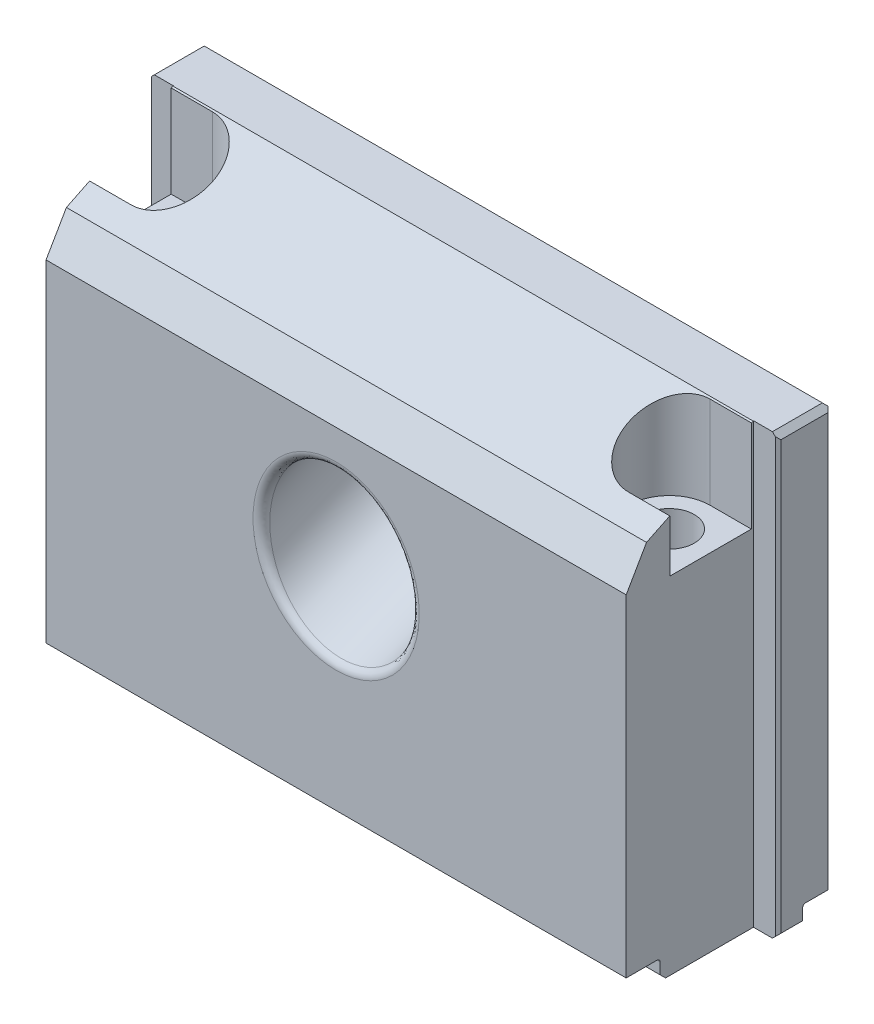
ISO-10303-21;
HEADER;
FILE_DESCRIPTION(('STEP AP214'),'2;1');
FILE_NAME('part.step','',(''),(''),'','','');
FILE_SCHEMA(('AUTOMOTIVE_DESIGN { 1 0 10303 214 1 1 1 1 }'));
ENDSEC;
DATA;
#1=APPLICATION_CONTEXT('core data for automotive mechanical design processes');
#2=APPLICATION_PROTOCOL_DEFINITION('international standard','automotive_design',2000,#1);
#3=PRODUCT_CONTEXT('',#1,'mechanical');
#4=PRODUCT('Part','Part','',(#3));
#5=PRODUCT_RELATED_PRODUCT_CATEGORY('part','',(#4));
#6=PRODUCT_DEFINITION_FORMATION('','',#4);
#7=PRODUCT_DEFINITION_CONTEXT('part definition',#1,'design');
#8=PRODUCT_DEFINITION('design','',#6,#7);
#9=PRODUCT_DEFINITION_SHAPE('','',#8);
#10=(LENGTH_UNIT() NAMED_UNIT(*) SI_UNIT(.MILLI.,.METRE.));
#11=(NAMED_UNIT(*) PLANE_ANGLE_UNIT() SI_UNIT($,.RADIAN.));
#12=(NAMED_UNIT(*) SI_UNIT($,.STERADIAN.) SOLID_ANGLE_UNIT());
#13=UNCERTAINTY_MEASURE_WITH_UNIT(LENGTH_MEASURE(1.E-05),#10,'distance_accuracy_value','');
#14=(GEOMETRIC_REPRESENTATION_CONTEXT(3) GLOBAL_UNCERTAINTY_ASSIGNED_CONTEXT((#13)) GLOBAL_UNIT_ASSIGNED_CONTEXT((#10,
#11,#12)) REPRESENTATION_CONTEXT('',''));
#15=CARTESIAN_POINT('',(0.,0.,0.));
#16=DIRECTION('',(0.,0.,1.));
#17=DIRECTION('',(1.,0.,0.));
#18=AXIS2_PLACEMENT_3D('',#15,#16,#17);
#19=CARTESIAN_POINT('',(-11.43,11.43,-8.636));
#20=DIRECTION('',(0.,0.,1.));
#21=DIRECTION('',(1.,0.,0.));
#22=AXIS2_PLACEMENT_3D('',#19,#20,#21);
#23=PLANE('',#22);
#24=CARTESIAN_POINT('',(-11.43,11.43,-8.636));
#25=DIRECTION('',(0.,0.,1.));
#26=DIRECTION('',(1.,0.,0.));
#27=AXIS2_PLACEMENT_3D('',#24,#25,#26);
#28=CIRCLE('',#27,6.35);
#29=CARTESIAN_POINT('',(-5.08,11.43,-8.636));
#30=VERTEX_POINT('',#29);
#31=EDGE_CURVE('E364',#30,#30,#28,.T.);
#32=ORIENTED_EDGE('',*,*,#31,.F.);
#33=EDGE_LOOP('',(#32));
#34=FACE_BOUND('',#33,.T.);
#35=CARTESIAN_POINT('',(-11.43,15.24,-8.636));
#36=DIRECTION('',(0.,0.,1.));
#37=DIRECTION('',(1.,0.,0.));
#38=AXIS2_PLACEMENT_3D('',#35,#36,#37);
#39=CIRCLE('',#38,0.889);
#40=CARTESIAN_POINT('',(-10.541,15.24,-8.636));
#41=VERTEX_POINT('',#40);
#42=EDGE_CURVE('E361',#41,#41,#39,.T.);
#43=ORIENTED_EDGE('',*,*,#42,.T.);
#44=EDGE_LOOP('',(#43));
#45=FACE_BOUND('',#44,.T.);
#46=DIRECTION('',(-0.999999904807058,-0.00043633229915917,0.));
#47=VECTOR('',#46,1.);
#48=CARTESIAN_POINT('',(-12.5221998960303,15.2395234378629,-8.636));
#49=LINE('',#48,#47);
#50=CARTESIAN_POINT('',(-12.5224538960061,15.2395233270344,-8.636));
#51=VERTEX_POINT('',#50);
#52=CARTESIAN_POINT('',(-12.5221998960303,15.2395234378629,-8.636));
#53=VERTEX_POINT('',#52);
#54=EDGE_CURVE('E306',#51,#53,#49,.F.);
#55=ORIENTED_EDGE('',*,*,#54,.F.);
#56=CARTESIAN_POINT('',(-11.43,15.24,-8.636));
#57=DIRECTION('',(0.,0.,-1.));
#58=DIRECTION('',(-1.,0.,0.));
#59=AXIS2_PLACEMENT_3D('',#56,#57,#58);
#60=CIRCLE('',#59,1.092454);
#61=CARTESIAN_POINT('',(-12.522454,15.24,-8.636));
#62=VERTEX_POINT('',#61);
#63=EDGE_CURVE('E1319',#62,#51,#60,.T.);
#64=ORIENTED_EDGE('',*,*,#63,.F.);
#65=DIRECTION('',(-1.,0.,0.));
#66=VECTOR('',#65,1.);
#67=CARTESIAN_POINT('',(-12.5222,15.24,-8.636));
#68=LINE('',#67,#66);
#69=CARTESIAN_POINT('',(-12.5222,15.24,-8.636));
#70=VERTEX_POINT('',#69);
#71=EDGE_CURVE('E33',#62,#70,#68,.F.);
#72=ORIENTED_EDGE('',*,*,#71,.T.);
#73=CARTESIAN_POINT('',(-11.43,15.24,-8.636));
#74=DIRECTION('',(0.,0.,-1.));
#75=DIRECTION('',(-1.,0.,0.));
#76=AXIS2_PLACEMENT_3D('',#73,#74,#75);
#77=CIRCLE('',#76,1.0922);
#78=EDGE_CURVE('E1332',#70,#53,#77,.T.);
#79=ORIENTED_EDGE('',*,*,#78,.T.);
#80=EDGE_LOOP('',(#55,#64,#72,#79));
#81=FACE_BOUND('',#80,.T.);
#82=ADVANCED_FACE('F15',(#34,#45,#81),#23,.F.);
#83=CARTESIAN_POINT('',(22.479,0.,-7.62));
#84=DIRECTION('',(0.,1.,0.));
#85=DIRECTION('',(0.,0.,1.));
#86=AXIS2_PLACEMENT_3D('',#83,#84,#85);
#87=CYLINDRICAL_SURFACE('',#86,2.2479);
#88=CARTESIAN_POINT('',(22.479,0.,-7.62));
#89=DIRECTION('',(0.,1.,0.));
#90=DIRECTION('',(0.,0.,1.));
#91=AXIS2_PLACEMENT_3D('',#88,#89,#90);
#92=CIRCLE('',#91,2.2479);
#93=CARTESIAN_POINT('',(22.479,0.,-5.3721));
#94=VERTEX_POINT('',#93);
#95=EDGE_CURVE('E355',#94,#94,#92,.T.);
#96=ORIENTED_EDGE('',*,*,#95,.F.);
#97=EDGE_LOOP('',(#96));
#98=FACE_BOUND('',#97,.T.);
#99=CARTESIAN_POINT('',(22.479,31.242,-7.62));
#100=DIRECTION('',(0.,1.,0.));
#101=DIRECTION('',(0.,0.,1.));
#102=AXIS2_PLACEMENT_3D('',#99,#100,#101);
#103=CIRCLE('',#102,2.2479);
#104=CARTESIAN_POINT('',(22.479,31.242,-5.3721));
#105=VERTEX_POINT('',#104);
#106=EDGE_CURVE('E326',#105,#105,#103,.F.);
#107=ORIENTED_EDGE('',*,*,#106,.F.);
#108=EDGE_LOOP('',(#107));
#109=FACE_BOUND('',#108,.T.);
#110=ADVANCED_FACE('F519',(#98,#109),#87,.F.);
#111=CARTESIAN_POINT('',(-22.479,0.,-7.62));
#112=DIRECTION('',(0.,1.,0.));
#113=DIRECTION('',(0.,0.,1.));
#114=AXIS2_PLACEMENT_3D('',#111,#112,#113);
#115=CYLINDRICAL_SURFACE('',#114,2.2479);
#116=CARTESIAN_POINT('',(-22.479,0.,-7.62));
#117=DIRECTION('',(0.,1.,0.));
#118=DIRECTION('',(0.,0.,1.));
#119=AXIS2_PLACEMENT_3D('',#116,#117,#118);
#120=CIRCLE('',#119,2.2479);
#121=CARTESIAN_POINT('',(-22.479,0.,-5.3721));
#122=VERTEX_POINT('',#121);
#123=EDGE_CURVE('E358',#122,#122,#120,.T.);
#124=ORIENTED_EDGE('',*,*,#123,.F.);
#125=EDGE_LOOP('',(#124));
#126=FACE_BOUND('',#125,.T.);
#127=CARTESIAN_POINT('',(-22.479,31.242,-7.62));
#128=DIRECTION('',(0.,1.,0.));
#129=DIRECTION('',(0.,0.,1.));
#130=AXIS2_PLACEMENT_3D('',#127,#128,#129);
#131=CIRCLE('',#130,2.2479);
#132=CARTESIAN_POINT('',(-22.479,31.242,-5.3721));
#133=VERTEX_POINT('',#132);
#134=EDGE_CURVE('E347',#133,#133,#131,.F.);
#135=ORIENTED_EDGE('',*,*,#134,.F.);
#136=EDGE_LOOP('',(#135));
#137=FACE_BOUND('',#136,.T.);
#138=ADVANCED_FACE('F525',(#126,#137),#115,.F.);
#139=CARTESIAN_POINT('',(145.151981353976,1.778,0.));
#140=DIRECTION('',(0.,1.,0.));
#141=DIRECTION('',(0.,0.,1.));
#142=AXIS2_PLACEMENT_3D('',#139,#140,#141);
#143=PLANE('',#142);
#144=DIRECTION('',(0.,0.,-1.));
#145=VECTOR('',#144,1.);
#146=CARTESIAN_POINT('',(-26.2001,1.778,0.));
#147=LINE('',#146,#145);
#148=CARTESIAN_POINT('',(-26.2001,1.778,0.));
#149=VERTEX_POINT('',#148);
#150=CARTESIAN_POINT('',(-26.2001,1.778,-2.794));
#151=VERTEX_POINT('',#150);
#152=EDGE_CURVE('E377',#149,#151,#147,.T.);
#153=ORIENTED_EDGE('',*,*,#152,.T.);
#154=DIRECTION('',(-1.,0.,0.));
#155=VECTOR('',#154,1.);
#156=CARTESIAN_POINT('',(26.2001,1.778,-2.794));
#157=LINE('',#156,#155);
#158=CARTESIAN_POINT('',(26.2001,1.778,-2.794));
#159=VERTEX_POINT('',#158);
#160=EDGE_CURVE('E660',#151,#159,#157,.F.);
#161=ORIENTED_EDGE('',*,*,#160,.T.);
#162=DIRECTION('',(0.,0.,1.));
#163=VECTOR('',#162,1.);
#164=CARTESIAN_POINT('',(26.2001,1.778,-11.4808));
#165=LINE('',#164,#163);
#166=CARTESIAN_POINT('',(26.2001,1.778,0.));
#167=VERTEX_POINT('',#166);
#168=EDGE_CURVE('E379',#159,#167,#165,.T.);
#169=ORIENTED_EDGE('',*,*,#168,.T.);
#170=DIRECTION('',(-1.,0.,0.));
#171=VECTOR('',#170,1.);
#172=CARTESIAN_POINT('',(145.151981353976,1.778,0.));
#173=LINE('',#172,#171);
#174=EDGE_CURVE('E368',#167,#149,#173,.T.);
#175=ORIENTED_EDGE('',*,*,#174,.T.);
#176=EDGE_LOOP('',(#153,#161,#169,#175));
#177=FACE_BOUND('',#176,.T.);
#178=ADVANCED_FACE('F546',(#177),#143,.F.);
#179=CARTESIAN_POINT('',(145.151981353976,1.778,-3.048));
#180=DIRECTION('',(0.,0.,-1.));
#181=DIRECTION('',(-1.,0.,0.));
#182=AXIS2_PLACEMENT_3D('',#179,#180,#181);
#183=PLANE('',#182);
#184=DIRECTION('',(0.,1.,0.));
#185=VECTOR('',#184,1.);
#186=CARTESIAN_POINT('',(26.2001,37.846,-3.048));
#187=LINE('',#186,#185);
#188=CARTESIAN_POINT('',(26.2001,0.508,-3.048));
#189=VERTEX_POINT('',#188);
#190=CARTESIAN_POINT('',(26.2001,1.524,-3.048));
#191=VERTEX_POINT('',#190);
#192=EDGE_CURVE('E381',#189,#191,#187,.T.);
#193=ORIENTED_EDGE('',*,*,#192,.T.);
#194=DIRECTION('',(-1.,0.,0.));
#195=VECTOR('',#194,1.);
#196=CARTESIAN_POINT('',(-26.2001,1.524,-3.048));
#197=LINE('',#196,#195);
#198=CARTESIAN_POINT('',(-26.2001,1.524,-3.048));
#199=VERTEX_POINT('',#198);
#200=EDGE_CURVE('E657',#191,#199,#197,.T.);
#201=ORIENTED_EDGE('',*,*,#200,.T.);
#202=DIRECTION('',(0.,-1.,0.));
#203=VECTOR('',#202,1.);
#204=CARTESIAN_POINT('',(-26.2001,37.846,-3.048));
#205=LINE('',#204,#203);
#206=CARTESIAN_POINT('',(-26.2001,0.508,-3.048));
#207=VERTEX_POINT('',#206);
#208=EDGE_CURVE('E413',#199,#207,#205,.T.);
#209=ORIENTED_EDGE('',*,*,#208,.T.);
#210=DIRECTION('',(1.,0.,0.));
#211=VECTOR('',#210,1.);
#212=CARTESIAN_POINT('',(26.2001,0.508,-3.048));
#213=LINE('',#212,#211);
#214=EDGE_CURVE('E648',#207,#189,#213,.T.);
#215=ORIENTED_EDGE('',*,*,#214,.T.);
#216=EDGE_LOOP('',(#193,#201,#209,#215));
#217=FACE_BOUND('',#216,.T.);
#218=ADVANCED_FACE('F542',(#217),#183,.F.);
#219=CARTESIAN_POINT('',(-28.4226,37.846,-11.4808));
#220=DIRECTION('',(-1.,0.,0.));
#221=DIRECTION('',(0.,0.,1.));
#222=AXIS2_PLACEMENT_3D('',#219,#220,#221);
#223=PLANE('',#222);
#224=DIRECTION('',(0.,1.,0.));
#225=VECTOR('',#224,1.);
#226=CARTESIAN_POINT('',(-28.4226,37.846,-13.716));
#227=LINE('',#226,#225);
#228=CARTESIAN_POINT('',(-28.4226,0.508,-13.716));
#229=VERTEX_POINT('',#228);
#230=CARTESIAN_POINT('',(-28.4226,1.524,-13.716));
#231=VERTEX_POINT('',#230);
#232=EDGE_CURVE('E398',#229,#231,#227,.T.);
#233=ORIENTED_EDGE('',*,*,#232,.F.);
#234=DIRECTION('',(0.,0.,1.));
#235=VECTOR('',#234,1.);
#236=CARTESIAN_POINT('',(-28.4226,0.508,-11.4808));
#237=LINE('',#236,#235);
#238=CARTESIAN_POINT('',(-28.4226,0.508000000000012,-11.75004));
#239=VERTEX_POINT('',#238);
#240=EDGE_CURVE('E575',#229,#239,#237,.T.);
#241=ORIENTED_EDGE('',*,*,#240,.T.);
#242=DIRECTION('',(0.,1.,0.));
#243=VECTOR('',#242,1.);
#244=CARTESIAN_POINT('',(-28.4226,37.846,-11.75004));
#245=LINE('',#244,#243);
#246=CARTESIAN_POINT('',(-28.4226,39.116,-11.75004));
#247=VERTEX_POINT('',#246);
#248=EDGE_CURVE('E708',#239,#247,#245,.T.);
#249=ORIENTED_EDGE('',*,*,#248,.T.);
#250=DIRECTION('',(0.,0.,-1.));
#251=VECTOR('',#250,1.);
#252=CARTESIAN_POINT('',(-28.4226,39.116,-16.002));
#253=LINE('',#252,#251);
#254=CARTESIAN_POINT('',(-28.4226,39.116,-16.002));
#255=VERTEX_POINT('',#254);
#256=EDGE_CURVE('E590',#247,#255,#253,.T.);
#257=ORIENTED_EDGE('',*,*,#256,.T.);
#258=DIRECTION('',(0.,-1.,0.));
#259=VECTOR('',#258,1.);
#260=CARTESIAN_POINT('',(-28.4226,37.846,-16.002));
#261=LINE('',#260,#259);
#262=CARTESIAN_POINT('',(-28.4226,1.778,-16.002));
#263=VERTEX_POINT('',#262);
#264=EDGE_CURVE('E710',#255,#263,#261,.T.);
#265=ORIENTED_EDGE('',*,*,#264,.T.);
#266=DIRECTION('',(0.,0.,-1.));
#267=VECTOR('',#266,1.);
#268=CARTESIAN_POINT('',(-28.4226,1.778,-11.4808));
#269=LINE('',#268,#267);
#270=CARTESIAN_POINT('',(-28.4226,1.778,-13.97));
#271=VERTEX_POINT('',#270);
#272=EDGE_CURVE('E394',#271,#263,#269,.T.);
#273=ORIENTED_EDGE('',*,*,#272,.F.);
#274=CARTESIAN_POINT('',(-28.4226,1.524,-13.97));
#275=DIRECTION('',(-1.,0.,0.));
#276=DIRECTION('',(0.,0.,1.));
#277=AXIS2_PLACEMENT_3D('',#274,#275,#276);
#278=CIRCLE('',#277,0.254);
#279=EDGE_CURVE('E578',#271,#231,#278,.F.);
#280=ORIENTED_EDGE('',*,*,#279,.T.);
#281=EDGE_LOOP('',(#233,#241,#249,#257,#265,#273,#280));
#282=FACE_BOUND('',#281,.T.);
#283=ADVANCED_FACE('F545',(#282),#223,.T.);
#284=CARTESIAN_POINT('',(28.4226,37.846,-16.256));
#285=DIRECTION('',(1.,0.,0.));
#286=DIRECTION('',(0.,0.,-1.));
#287=AXIS2_PLACEMENT_3D('',#284,#285,#286);
#288=PLANE('',#287);
#289=DIRECTION('',(0.,-1.,0.));
#290=VECTOR('',#289,1.);
#291=CARTESIAN_POINT('',(28.4226,37.846,-11.75004));
#292=LINE('',#291,#290);
#293=CARTESIAN_POINT('',(28.4226,39.116,-11.75004));
#294=VERTEX_POINT('',#293);
#295=CARTESIAN_POINT('',(28.4226,0.508,-11.75004));
#296=VERTEX_POINT('',#295);
#297=EDGE_CURVE('E688',#294,#296,#292,.T.);
#298=ORIENTED_EDGE('',*,*,#297,.T.);
#299=DIRECTION('',(0.,0.,-1.));
#300=VECTOR('',#299,1.);
#301=CARTESIAN_POINT('',(28.4226,0.508,-16.256));
#302=LINE('',#301,#300);
#303=CARTESIAN_POINT('',(28.4226,0.508000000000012,-13.716));
#304=VERTEX_POINT('',#303);
#305=EDGE_CURVE('E612',#296,#304,#302,.T.);
#306=ORIENTED_EDGE('',*,*,#305,.T.);
#307=DIRECTION('',(0.,-1.,0.));
#308=VECTOR('',#307,1.);
#309=CARTESIAN_POINT('',(28.4226,37.846,-13.716));
#310=LINE('',#309,#308);
#311=CARTESIAN_POINT('',(28.4226,1.524,-13.716));
#312=VERTEX_POINT('',#311);
#313=EDGE_CURVE('E396',#312,#304,#310,.T.);
#314=ORIENTED_EDGE('',*,*,#313,.F.);
#315=CARTESIAN_POINT('',(28.4226,1.524,-13.97));
#316=DIRECTION('',(1.,0.,0.));
#317=DIRECTION('',(0.,0.,-1.));
#318=AXIS2_PLACEMENT_3D('',#315,#316,#317);
#319=CIRCLE('',#318,0.254);
#320=CARTESIAN_POINT('',(28.4226,1.778,-13.97));
#321=VERTEX_POINT('',#320);
#322=EDGE_CURVE('E663',#312,#321,#319,.F.);
#323=ORIENTED_EDGE('',*,*,#322,.T.);
#324=DIRECTION('',(0.,0.,1.));
#325=VECTOR('',#324,1.);
#326=CARTESIAN_POINT('',(28.4226,1.778,-16.256));
#327=LINE('',#326,#325);
#328=CARTESIAN_POINT('',(28.4226,1.778,-16.002));
#329=VERTEX_POINT('',#328);
#330=EDGE_CURVE('E391',#329,#321,#327,.T.);
#331=ORIENTED_EDGE('',*,*,#330,.F.);
#332=DIRECTION('',(0.,1.,0.));
#333=VECTOR('',#332,1.);
#334=CARTESIAN_POINT('',(28.4226,37.846,-16.002));
#335=LINE('',#334,#333);
#336=CARTESIAN_POINT('',(28.4226,39.116,-16.002));
#337=VERTEX_POINT('',#336);
#338=EDGE_CURVE('E697',#329,#337,#335,.T.);
#339=ORIENTED_EDGE('',*,*,#338,.T.);
#340=DIRECTION('',(0.,0.,1.));
#341=VECTOR('',#340,1.);
#342=CARTESIAN_POINT('',(28.4226,39.116,-11.75004));
#343=LINE('',#342,#341);
#344=EDGE_CURVE('E610',#337,#294,#343,.T.);
#345=ORIENTED_EDGE('',*,*,#344,.T.);
#346=EDGE_LOOP('',(#298,#306,#314,#323,#331,#339,#345));
#347=FACE_BOUND('',#346,.T.);
#348=ADVANCED_FACE('F563',(#347),#288,.T.);
#349=CARTESIAN_POINT('',(26.2001,0.,-11.4808));
#350=DIRECTION('',(0.,-1.,0.));
#351=DIRECTION('',(0.,0.,-1.));
#352=AXIS2_PLACEMENT_3D('',#349,#350,#351);
#353=PLANE('',#352);
#354=ORIENTED_EDGE('',*,*,#95,.T.);
#355=EDGE_LOOP('',(#354));
#356=FACE_BOUND('',#355,.T.);
#357=ORIENTED_EDGE('',*,*,#123,.T.);
#358=EDGE_LOOP('',(#357));
#359=FACE_BOUND('',#358,.T.);
#360=DIRECTION('',(0.,0.,-1.));
#361=VECTOR('',#360,1.);
#362=CARTESIAN_POINT('',(-27.9146,0.,-11.4808));
#363=LINE('',#362,#361);
#364=CARTESIAN_POINT('',(-27.9146,0.,-11.49604));
#365=VERTEX_POINT('',#364);
#366=CARTESIAN_POINT('',(-27.9146,0.,-13.208));
#367=VERTEX_POINT('',#366);
#368=EDGE_CURVE('E593',#365,#367,#363,.T.);
#369=ORIENTED_EDGE('',*,*,#368,.T.);
#370=DIRECTION('',(1.,0.,0.));
#371=VECTOR('',#370,1.);
#372=CARTESIAN_POINT('',(27.9146,0.,-13.208));
#373=LINE('',#372,#371);
#374=CARTESIAN_POINT('',(27.9146,0.,-13.208));
#375=VERTEX_POINT('',#374);
#376=EDGE_CURVE('E640',#367,#375,#373,.T.);
#377=ORIENTED_EDGE('',*,*,#376,.T.);
#378=DIRECTION('',(0.,0.,1.));
#379=VECTOR('',#378,1.);
#380=CARTESIAN_POINT('',(27.9146,0.,-11.4808));
#381=LINE('',#380,#379);
#382=CARTESIAN_POINT('',(27.9146,0.,-11.49604));
#383=VERTEX_POINT('',#382);
#384=EDGE_CURVE('E684',#375,#383,#381,.T.);
#385=ORIENTED_EDGE('',*,*,#384,.T.);
#386=DIRECTION('',(-1.,0.,0.));
#387=VECTOR('',#386,1.);
#388=CARTESIAN_POINT('',(26.2001,0.,-11.49604));
#389=LINE('',#388,#387);
#390=CARTESIAN_POINT('',(26.2001,0.,-11.49604));
#391=VERTEX_POINT('',#390);
#392=EDGE_CURVE('E431',#383,#391,#389,.T.);
#393=ORIENTED_EDGE('',*,*,#392,.T.);
#394=DIRECTION('',(0.,0.,1.));
#395=VECTOR('',#394,1.);
#396=CARTESIAN_POINT('',(26.2001,0.,-11.4808));
#397=LINE('',#396,#395);
#398=CARTESIAN_POINT('',(26.2001,0.,-3.556));
#399=VERTEX_POINT('',#398);
#400=EDGE_CURVE('E401',#391,#399,#397,.T.);
#401=ORIENTED_EDGE('',*,*,#400,.T.);
#402=DIRECTION('',(-1.,0.,0.));
#403=VECTOR('',#402,1.);
#404=CARTESIAN_POINT('',(-26.2001,0.,-3.556));
#405=LINE('',#404,#403);
#406=CARTESIAN_POINT('',(-26.2001,0.,-3.556));
#407=VERTEX_POINT('',#406);
#408=EDGE_CURVE('E637',#399,#407,#405,.T.);
#409=ORIENTED_EDGE('',*,*,#408,.T.);
#410=DIRECTION('',(0.,0.,-1.));
#411=VECTOR('',#410,1.);
#412=CARTESIAN_POINT('',(-26.2001,0.,0.));
#413=LINE('',#412,#411);
#414=CARTESIAN_POINT('',(-26.2001,0.,-11.49604));
#415=VERTEX_POINT('',#414);
#416=EDGE_CURVE('E402',#407,#415,#413,.T.);
#417=ORIENTED_EDGE('',*,*,#416,.T.);
#418=DIRECTION('',(-1.,0.,0.));
#419=VECTOR('',#418,1.);
#420=CARTESIAN_POINT('',(26.2001,0.,-11.49604));
#421=LINE('',#420,#419);
#422=EDGE_CURVE('E404',#415,#365,#421,.T.);
#423=ORIENTED_EDGE('',*,*,#422,.T.);
#424=EDGE_LOOP('',(#369,#377,#385,#393,#401,#409,#417,#423));
#425=FACE_BOUND('',#424,.T.);
#426=ADVANCED_FACE('F508',(#356,#359,#425),#353,.T.);
#427=CARTESIAN_POINT('',(-26.2001,37.846,-11.49604));
#428=DIRECTION('',(0.,0.,1.));
#429=DIRECTION('',(1.,0.,0.));
#430=AXIS2_PLACEMENT_3D('',#427,#428,#429);
#431=PLANE('',#430);
#432=DIRECTION('',(0.,-1.,0.));
#433=VECTOR('',#432,1.);
#434=CARTESIAN_POINT('',(-28.1686,37.846,-11.49604));
#435=LINE('',#434,#433);
#436=CARTESIAN_POINT('',(-28.1686,39.37,-11.49604));
#437=VERTEX_POINT('',#436);
#438=CARTESIAN_POINT('',(-28.1686,0.254000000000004,-11.49604));
#439=VERTEX_POINT('',#438);
#440=EDGE_CURVE('E469',#437,#439,#435,.T.);
#441=ORIENTED_EDGE('',*,*,#440,.T.);
#442=DIRECTION('',(-0.707106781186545,0.70710678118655,0.));
#443=VECTOR('',#442,1.);
#444=CARTESIAN_POINT('',(-45.98035,18.06575,-11.49604));
#445=LINE('',#444,#443);
#446=EDGE_CURVE('E600',#439,#365,#445,.F.);
#447=ORIENTED_EDGE('',*,*,#446,.T.);
#448=ORIENTED_EDGE('',*,*,#422,.F.);
#449=DIRECTION('',(0.,-1.,0.));
#450=VECTOR('',#449,1.);
#451=CARTESIAN_POINT('',(-26.2001,37.846,-11.49604));
#452=LINE('',#451,#450);
#453=CARTESIAN_POINT('',(-26.2001,39.624,-11.49604));
#454=VERTEX_POINT('',#453);
#455=EDGE_CURVE('E410',#454,#415,#452,.T.);
#456=ORIENTED_EDGE('',*,*,#455,.F.);
#457=DIRECTION('',(1.,0.,0.));
#458=VECTOR('',#457,1.);
#459=CARTESIAN_POINT('',(-26.2001,39.624,-11.49604));
#460=LINE('',#459,#458);
#461=CARTESIAN_POINT('',(-27.9146,39.624,-11.49604));
#462=VERTEX_POINT('',#461);
#463=EDGE_CURVE('E387',#462,#454,#460,.T.);
#464=ORIENTED_EDGE('',*,*,#463,.F.);
#465=DIRECTION('',(-0.707106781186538,-0.707106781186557,0.));
#466=VECTOR('',#465,1.);
#467=CARTESIAN_POINT('',(-27.94635,39.59225,-11.49604));
#468=LINE('',#467,#466);
#469=EDGE_CURVE('E598',#462,#437,#468,.T.);
#470=ORIENTED_EDGE('',*,*,#469,.T.);
#471=EDGE_LOOP('',(#441,#447,#448,#456,#464,#470));
#472=FACE_BOUND('',#471,.T.);
#473=ADVANCED_FACE('F505',(#472),#431,.T.);
#474=CARTESIAN_POINT('',(-28.4226,37.846,-16.256));
#475=DIRECTION('',(0.,0.,-1.));
#476=DIRECTION('',(-1.,0.,0.));
#477=AXIS2_PLACEMENT_3D('',#474,#475,#476);
#478=PLANE('',#477);
#479=CARTESIAN_POINT('',(0.,27.1514190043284,-16.256));
#480=DIRECTION('',(0.,0.,-1.));
#481=DIRECTION('',(0.,-1.,0.));
#482=AXIS2_PLACEMENT_3D('',#479,#480,#481);
#483=ELLIPSE('',#482,8.15389508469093,7.5057);
#484=CARTESIAN_POINT('',(0.,18.9975239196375,-16.256));
#485=VERTEX_POINT('',#484);
#486=EDGE_CURVE('E473',#485,#485,#483,.F.);
#487=ORIENTED_EDGE('',*,*,#486,.T.);
#488=EDGE_LOOP('',(#487));
#489=FACE_BOUND('',#488,.T.);
#490=CARTESIAN_POINT('',(-11.43,11.43,-16.256));
#491=DIRECTION('',(0.,0.,-1.));
#492=DIRECTION('',(-1.,0.,0.));
#493=AXIS2_PLACEMENT_3D('',#490,#491,#492);
#494=CIRCLE('',#493,6.35);
#495=CARTESIAN_POINT('',(-17.78,11.43,-16.256));
#496=VERTEX_POINT('',#495);
#497=EDGE_CURVE('E367',#496,#496,#494,.T.);
#498=ORIENTED_EDGE('',*,*,#497,.F.);
#499=EDGE_LOOP('',(#498));
#500=FACE_BOUND('',#499,.T.);
#501=DIRECTION('',(0.,1.,0.));
#502=VECTOR('',#501,1.);
#503=CARTESIAN_POINT('',(-28.1686,37.846,-16.256));
#504=LINE('',#503,#502);
#505=CARTESIAN_POINT('',(-28.1686,1.778,-16.256));
#506=VERTEX_POINT('',#505);
#507=CARTESIAN_POINT('',(-28.1686,39.37,-16.256));
#508=VERTEX_POINT('',#507);
#509=EDGE_CURVE('E700',#506,#508,#504,.T.);
#510=ORIENTED_EDGE('',*,*,#509,.T.);
#511=DIRECTION('',(1.,0.,0.));
#512=VECTOR('',#511,1.);
#513=CARTESIAN_POINT('',(27.9146,39.37,-16.256));
#514=LINE('',#513,#512);
#515=CARTESIAN_POINT('',(28.1686,39.37,-16.256));
#516=VERTEX_POINT('',#515);
#517=EDGE_CURVE('E630',#508,#516,#514,.T.);
#518=ORIENTED_EDGE('',*,*,#517,.T.);
#519=DIRECTION('',(0.,-1.,0.));
#520=VECTOR('',#519,1.);
#521=CARTESIAN_POINT('',(28.1686,37.846,-16.256));
#522=LINE('',#521,#520);
#523=CARTESIAN_POINT('',(28.1686,1.778,-16.256));
#524=VERTEX_POINT('',#523);
#525=EDGE_CURVE('E703',#516,#524,#522,.T.);
#526=ORIENTED_EDGE('',*,*,#525,.T.);
#527=DIRECTION('',(-1.,0.,0.));
#528=VECTOR('',#527,1.);
#529=CARTESIAN_POINT('',(145.151981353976,1.778,-16.256));
#530=LINE('',#529,#528);
#531=EDGE_CURVE('E374',#524,#506,#530,.T.);
#532=ORIENTED_EDGE('',*,*,#531,.T.);
#533=EDGE_LOOP('',(#510,#518,#526,#532));
#534=FACE_BOUND('',#533,.T.);
#535=ADVANCED_FACE('F507',(#489,#500,#534),#478,.T.);
#536=CARTESIAN_POINT('',(28.4226,37.846,-11.49604));
#537=DIRECTION('',(0.,0.,1.));
#538=DIRECTION('',(1.,0.,0.));
#539=AXIS2_PLACEMENT_3D('',#536,#537,#538);
#540=PLANE('',#539);
#541=ORIENTED_EDGE('',*,*,#392,.F.);
#542=DIRECTION('',(-0.707106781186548,-0.707106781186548,0.));
#543=VECTOR('',#542,1.);
#544=CARTESIAN_POINT('',(47.0916,19.177,-11.49604));
#545=LINE('',#544,#543);
#546=CARTESIAN_POINT('',(28.1686,0.254,-11.49604));
#547=VERTEX_POINT('',#546);
#548=EDGE_CURVE('E604',#383,#547,#545,.F.);
#549=ORIENTED_EDGE('',*,*,#548,.T.);
#550=DIRECTION('',(0.,1.,0.));
#551=VECTOR('',#550,1.);
#552=CARTESIAN_POINT('',(28.1686,37.846,-11.49604));
#553=LINE('',#552,#551);
#554=CARTESIAN_POINT('',(28.1686,39.37,-11.49604));
#555=VERTEX_POINT('',#554);
#556=EDGE_CURVE('E692',#547,#555,#553,.T.);
#557=ORIENTED_EDGE('',*,*,#556,.T.);
#558=DIRECTION('',(-0.707106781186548,0.707106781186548,0.));
#559=VECTOR('',#558,1.);
#560=CARTESIAN_POINT('',(29.0576,38.481,-11.49604));
#561=LINE('',#560,#559);
#562=CARTESIAN_POINT('',(27.9146,39.624,-11.49604));
#563=VERTEX_POINT('',#562);
#564=EDGE_CURVE('E602',#555,#563,#561,.T.);
#565=ORIENTED_EDGE('',*,*,#564,.T.);
#566=DIRECTION('',(1.,0.,0.));
#567=VECTOR('',#566,1.);
#568=CARTESIAN_POINT('',(28.4226,39.624,-11.49604));
#569=LINE('',#568,#567);
#570=CARTESIAN_POINT('',(26.2001,39.624,-11.49604));
#571=VERTEX_POINT('',#570);
#572=EDGE_CURVE('E390',#571,#563,#569,.T.);
#573=ORIENTED_EDGE('',*,*,#572,.F.);
#574=DIRECTION('',(0.,-1.,0.));
#575=VECTOR('',#574,1.);
#576=CARTESIAN_POINT('',(26.2001,37.846,-11.49604));
#577=LINE('',#576,#575);
#578=EDGE_CURVE('E428',#571,#391,#577,.T.);
#579=ORIENTED_EDGE('',*,*,#578,.T.);
#580=EDGE_LOOP('',(#541,#549,#557,#565,#573,#579));
#581=FACE_BOUND('',#580,.T.);
#582=ADVANCED_FACE('F503',(#581),#540,.T.);
#583=CARTESIAN_POINT('',(26.2001,37.846,-11.4808));
#584=DIRECTION('',(1.,0.,0.));
#585=DIRECTION('',(0.,0.,-1.));
#586=AXIS2_PLACEMENT_3D('',#583,#584,#585);
#587=PLANE('',#586);
#588=ORIENTED_EDGE('',*,*,#192,.F.);
#589=DIRECTION('',(0.,-0.707106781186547,-0.707106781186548));
#590=VECTOR('',#589,1.);
#591=CARTESIAN_POINT('',(26.2001,14.9606,11.4046));
#592=LINE('',#591,#590);
#593=EDGE_CURVE('E650',#189,#399,#592,.T.);
#594=ORIENTED_EDGE('',*,*,#593,.T.);
#595=ORIENTED_EDGE('',*,*,#400,.F.);
#596=ORIENTED_EDGE('',*,*,#578,.F.);
#597=DIRECTION('',(0.,0.,-1.));
#598=VECTOR('',#597,1.);
#599=CARTESIAN_POINT('',(26.2001,39.624,-11.4808));
#600=LINE('',#599,#598);
#601=CARTESIAN_POINT('',(26.2001,39.624,-11.4551754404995));
#602=VERTEX_POINT('',#601);
#603=EDGE_CURVE('E388',#602,#571,#600,.T.);
#604=ORIENTED_EDGE('',*,*,#603,.F.);
#605=DIRECTION('',(0.,0.438371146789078,-0.898794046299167));
#606=VECTOR('',#605,1.);
#607=CARTESIAN_POINT('',(26.2001,39.292419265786,-10.7753341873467));
#608=LINE('',#607,#606);
#609=CARTESIAN_POINT('',(26.2001,39.5497790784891,-11.3030000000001));
#610=VERTEX_POINT('',#609);
#611=EDGE_CURVE('E384',#610,#602,#608,.T.);
#612=ORIENTED_EDGE('',*,*,#611,.F.);
#613=DIRECTION('',(0.,1.,0.));
#614=VECTOR('',#613,1.);
#615=CARTESIAN_POINT('',(26.2001,37.846,-11.303));
#616=LINE('',#615,#614);
#617=CARTESIAN_POINT('',(26.2001,31.242,-11.303));
#618=VERTEX_POINT('',#617);
#619=EDGE_CURVE('E330',#618,#610,#616,.T.);
#620=ORIENTED_EDGE('',*,*,#619,.F.);
#621=DIRECTION('',(0.,0.,1.));
#622=VECTOR('',#621,1.);
#623=CARTESIAN_POINT('',(26.2001,31.242,-11.4808));
#624=LINE('',#623,#622);
#625=CARTESIAN_POINT('',(26.2001,31.242,-3.93700000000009));
#626=VERTEX_POINT('',#625);
#627=EDGE_CURVE('E327',#618,#626,#624,.T.);
#628=ORIENTED_EDGE('',*,*,#627,.T.);
#629=DIRECTION('',(0.,-1.,0.));
#630=VECTOR('',#629,1.);
#631=CARTESIAN_POINT('',(26.2001,37.846,-3.93700000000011));
#632=LINE('',#631,#630);
#633=CARTESIAN_POINT('',(26.2001,35.957140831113,-3.93700000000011));
#634=VERTEX_POINT('',#633);
#635=EDGE_CURVE('E332',#634,#626,#632,.T.);
#636=ORIENTED_EDGE('',*,*,#635,.F.);
#637=CARTESIAN_POINT('',(26.2001,34.9333433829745,-1.8379041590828));
#638=VERTEX_POINT('',#637);
#639=EDGE_CURVE('E385',#638,#634,#608,.T.);
#640=ORIENTED_EDGE('',*,*,#639,.F.);
#641=DIRECTION('',(0.,-0.866025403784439,0.5));
#642=VECTOR('',#641,1.);
#643=CARTESIAN_POINT('',(26.2001,41.2933322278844,-5.50984543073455));
#644=LINE('',#643,#642);
#645=CARTESIAN_POINT('',(26.2001,31.750000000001,0.));
#646=VERTEX_POINT('',#645);
#647=EDGE_CURVE('E463',#638,#646,#644,.T.);
#648=ORIENTED_EDGE('',*,*,#647,.T.);
#649=DIRECTION('',(0.,-1.,0.));
#650=VECTOR('',#649,1.);
#651=CARTESIAN_POINT('',(26.2001,37.846,0.));
#652=LINE('',#651,#650);
#653=EDGE_CURVE('E409',#646,#167,#652,.T.);
#654=ORIENTED_EDGE('',*,*,#653,.T.);
#655=ORIENTED_EDGE('',*,*,#168,.F.);
#656=CARTESIAN_POINT('',(26.2001,1.524,-2.794));
#657=DIRECTION('',(1.,0.,0.));
#658=DIRECTION('',(0.,0.,-1.));
#659=AXIS2_PLACEMENT_3D('',#656,#657,#658);
#660=CIRCLE('',#659,0.254);
#661=EDGE_CURVE('E9',#159,#191,#660,.F.);
#662=ORIENTED_EDGE('',*,*,#661,.T.);
#663=EDGE_LOOP('',(#588,#594,#595,#596,#604,#612,#620,#628,#636,#640,#648,#654,#655,#662));
#664=FACE_BOUND('',#663,.T.);
#665=ADVANCED_FACE('F500',(#664),#587,.T.);
#666=CARTESIAN_POINT('',(-26.2001,37.846,0.));
#667=DIRECTION('',(-1.,0.,0.));
#668=DIRECTION('',(0.,0.,1.));
#669=AXIS2_PLACEMENT_3D('',#666,#667,#668);
#670=PLANE('',#669);
#671=ORIENTED_EDGE('',*,*,#416,.F.);
#672=DIRECTION('',(0.,0.707106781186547,0.707106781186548));
#673=VECTOR('',#672,1.);
#674=CARTESIAN_POINT('',(-26.2001,20.701,17.145));
#675=LINE('',#674,#673);
#676=EDGE_CURVE('E645',#407,#207,#675,.T.);
#677=ORIENTED_EDGE('',*,*,#676,.T.);
#678=ORIENTED_EDGE('',*,*,#208,.F.);
#679=CARTESIAN_POINT('',(-26.2001,1.524,-2.794));
#680=DIRECTION('',(-1.,0.,0.));
#681=DIRECTION('',(0.,0.,1.));
#682=AXIS2_PLACEMENT_3D('',#679,#680,#681);
#683=CIRCLE('',#682,0.254);
#684=EDGE_CURVE('E26',#199,#151,#683,.F.);
#685=ORIENTED_EDGE('',*,*,#684,.T.);
#686=ORIENTED_EDGE('',*,*,#152,.F.);
#687=DIRECTION('',(0.,-1.,0.));
#688=VECTOR('',#687,1.);
#689=CARTESIAN_POINT('',(-26.2001,37.846,0.));
#690=LINE('',#689,#688);
#691=CARTESIAN_POINT('',(-26.2001,31.750000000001,0.));
#692=VERTEX_POINT('',#691);
#693=EDGE_CURVE('E407',#692,#149,#690,.T.);
#694=ORIENTED_EDGE('',*,*,#693,.F.);
#695=DIRECTION('',(0.,0.866025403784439,-0.5));
#696=VECTOR('',#695,1.);
#697=CARTESIAN_POINT('',(-26.2001,36.322,-2.63964543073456));
#698=LINE('',#697,#696);
#699=CARTESIAN_POINT('',(-26.2001,34.9333433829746,-1.8379041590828));
#700=VERTEX_POINT('',#699);
#701=EDGE_CURVE('E467',#692,#700,#698,.T.);
#702=ORIENTED_EDGE('',*,*,#701,.T.);
#703=DIRECTION('',(0.,-0.438371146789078,0.898794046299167));
#704=VECTOR('',#703,1.);
#705=CARTESIAN_POINT('',(-26.2001,34.7689223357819,-1.50079105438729));
#706=LINE('',#705,#704);
#707=CARTESIAN_POINT('',(-26.2001,35.957140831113,-3.93700000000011));
#708=VERTEX_POINT('',#707);
#709=EDGE_CURVE('E415',#708,#700,#706,.T.);
#710=ORIENTED_EDGE('',*,*,#709,.F.);
#711=DIRECTION('',(0.,1.,0.));
#712=VECTOR('',#711,1.);
#713=CARTESIAN_POINT('',(-26.2001,37.846,-3.93700000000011));
#714=LINE('',#713,#712);
#715=CARTESIAN_POINT('',(-26.2001,31.242,-3.93700000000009));
#716=VERTEX_POINT('',#715);
#717=EDGE_CURVE('E353',#716,#708,#714,.T.);
#718=ORIENTED_EDGE('',*,*,#717,.F.);
#719=DIRECTION('',(0.,0.,-1.));
#720=VECTOR('',#719,1.);
#721=CARTESIAN_POINT('',(-26.2001,31.242,0.));
#722=LINE('',#721,#720);
#723=CARTESIAN_POINT('',(-26.2001,31.242,-11.303));
#724=VERTEX_POINT('',#723);
#725=EDGE_CURVE('E348',#716,#724,#722,.T.);
#726=ORIENTED_EDGE('',*,*,#725,.T.);
#727=DIRECTION('',(0.,-1.,0.));
#728=VECTOR('',#727,1.);
#729=CARTESIAN_POINT('',(-26.2001,37.846,-11.303));
#730=LINE('',#729,#728);
#731=CARTESIAN_POINT('',(-26.2001,39.5497790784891,-11.303));
#732=VERTEX_POINT('',#731);
#733=EDGE_CURVE('E351',#732,#724,#730,.T.);
#734=ORIENTED_EDGE('',*,*,#733,.F.);
#735=CARTESIAN_POINT('',(-26.2001,39.624,-11.4551754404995));
#736=VERTEX_POINT('',#735);
#737=EDGE_CURVE('E416',#736,#732,#706,.T.);
#738=ORIENTED_EDGE('',*,*,#737,.F.);
#739=DIRECTION('',(0.,0.,1.));
#740=VECTOR('',#739,1.);
#741=CARTESIAN_POINT('',(-26.2001,39.624,0.));
#742=LINE('',#741,#740);
#743=EDGE_CURVE('E419',#454,#736,#742,.T.);
#744=ORIENTED_EDGE('',*,*,#743,.F.);
#745=ORIENTED_EDGE('',*,*,#455,.T.);
#746=EDGE_LOOP('',(#671,#677,#678,#685,#686,#694,#702,#710,#718,#726,#734,#738,#744,#745));
#747=FACE_BOUND('',#746,.T.);
#748=ADVANCED_FACE('F497',(#747),#670,.T.);
#749=CARTESIAN_POINT('',(26.2001,37.846,0.));
#750=DIRECTION('',(0.,0.,1.));
#751=DIRECTION('',(1.,0.,0.));
#752=AXIS2_PLACEMENT_3D('',#749,#750,#751);
#753=PLANE('',#752);
#754=ORIENTED_EDGE('',*,*,#653,.F.);
#755=DIRECTION('',(-1.,0.,0.));
#756=VECTOR('',#755,1.);
#757=CARTESIAN_POINT('',(-26.2001,31.750000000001,0.));
#758=LINE('',#757,#756);
#759=EDGE_CURVE('E465',#646,#692,#758,.T.);
#760=ORIENTED_EDGE('',*,*,#759,.T.);
#761=ORIENTED_EDGE('',*,*,#693,.T.);
#762=ORIENTED_EDGE('',*,*,#174,.F.);
#763=EDGE_LOOP('',(#754,#760,#761,#762));
#764=FACE_BOUND('',#763,.T.);
#765=CARTESIAN_POINT('',(0.,20.8980560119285,0.));
#766=DIRECTION('',(0.,0.,1.));
#767=DIRECTION('',(0.,-1.,0.));
#768=AXIS2_PLACEMENT_3D('',#765,#766,#767);
#769=ELLIPSE('',#768,8.15389508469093,7.5057);
#770=CARTESIAN_POINT('',(0.,12.7441609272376,0.));
#771=VERTEX_POINT('',#770);
#772=EDGE_CURVE('E443',#771,#771,#769,.F.);
#773=ORIENTED_EDGE('',*,*,#772,.T.);
#774=EDGE_LOOP('',(#773));
#775=FACE_BOUND('',#774,.T.);
#776=ADVANCED_FACE('F491',(#764,#775),#753,.T.);
#777=CARTESIAN_POINT('',(145.151981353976,39.624,-11.4551754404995));
#778=DIRECTION('',(0.,-0.898794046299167,-0.438371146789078));
#779=DIRECTION('',(0.,0.438371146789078,-0.898794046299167));
#780=AXIS2_PLACEMENT_3D('',#777,#778,#779);
#781=PLANE('',#780);
#782=ORIENTED_EDGE('',*,*,#709,.T.);
#783=DIRECTION('',(1.,0.,0.));
#784=VECTOR('',#783,1.);
#785=CARTESIAN_POINT('',(26.2001,34.9333433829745,-1.83790415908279));
#786=LINE('',#785,#784);
#787=EDGE_CURVE('E460',#700,#638,#786,.T.);
#788=ORIENTED_EDGE('',*,*,#787,.T.);
#789=ORIENTED_EDGE('',*,*,#639,.T.);
#790=DIRECTION('',(-1.,0.,0.));
#791=VECTOR('',#790,1.);
#792=CARTESIAN_POINT('',(145.151981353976,35.957140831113,-3.93700000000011));
#793=LINE('',#792,#791);
#794=CARTESIAN_POINT('',(22.479,35.957140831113,-3.9370000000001));
#795=VERTEX_POINT('',#794);
#796=EDGE_CURVE('E457',#634,#795,#793,.T.);
#797=ORIENTED_EDGE('',*,*,#796,.T.);
#798=CARTESIAN_POINT('',(22.479,37.7534599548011,-7.62000000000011));
#799=DIRECTION('',(0.,-0.898794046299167,-0.438371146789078));
#800=DIRECTION('',(0.,0.438371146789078,-0.898794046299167));
#801=AXIS2_PLACEMENT_3D('',#798,#799,#800);
#802=ELLIPSE('',#801,4.09771294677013,3.683);
#803=CARTESIAN_POINT('',(22.479,39.5497790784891,-11.303));
#804=VERTEX_POINT('',#803);
#805=EDGE_CURVE('E454',#795,#804,#802,.T.);
#806=ORIENTED_EDGE('',*,*,#805,.T.);
#807=DIRECTION('',(1.,0.,0.));
#808=VECTOR('',#807,1.);
#809=CARTESIAN_POINT('',(145.151981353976,39.5497790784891,-11.303));
#810=LINE('',#809,#808);
#811=EDGE_CURVE('E449',#804,#610,#810,.T.);
#812=ORIENTED_EDGE('',*,*,#811,.T.);
#813=ORIENTED_EDGE('',*,*,#611,.T.);
#814=DIRECTION('',(-1.,0.,0.));
#815=VECTOR('',#814,1.);
#816=CARTESIAN_POINT('',(145.151981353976,39.624,-11.4551754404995));
#817=LINE('',#816,#815);
#818=EDGE_CURVE('E371',#602,#736,#817,.T.);
#819=ORIENTED_EDGE('',*,*,#818,.T.);
#820=ORIENTED_EDGE('',*,*,#737,.T.);
#821=DIRECTION('',(1.,0.,0.));
#822=VECTOR('',#821,1.);
#823=CARTESIAN_POINT('',(145.151981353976,39.5497790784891,-11.303));
#824=LINE('',#823,#822);
#825=CARTESIAN_POINT('',(-22.479,39.5497790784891,-11.303));
#826=VERTEX_POINT('',#825);
#827=EDGE_CURVE('E439',#732,#826,#824,.T.);
#828=ORIENTED_EDGE('',*,*,#827,.T.);
#829=CARTESIAN_POINT('',(-22.479,37.7534599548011,-7.62000000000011));
#830=DIRECTION('',(0.,-0.898794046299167,-0.438371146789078));
#831=DIRECTION('',(0.,0.438371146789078,-0.898794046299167));
#832=AXIS2_PLACEMENT_3D('',#829,#830,#831);
#833=ELLIPSE('',#832,4.09771294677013,3.683);
#834=CARTESIAN_POINT('',(-22.479,35.957140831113,-3.9370000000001));
#835=VERTEX_POINT('',#834);
#836=EDGE_CURVE('E442',#826,#835,#833,.T.);
#837=ORIENTED_EDGE('',*,*,#836,.T.);
#838=DIRECTION('',(-1.,0.,0.));
#839=VECTOR('',#838,1.);
#840=CARTESIAN_POINT('',(145.151981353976,35.957140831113,-3.93700000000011));
#841=LINE('',#840,#839);
#842=EDGE_CURVE('E446',#835,#708,#841,.T.);
#843=ORIENTED_EDGE('',*,*,#842,.T.);
#844=EDGE_LOOP('',(#782,#788,#789,#797,#806,#812,#813,#819,#820,#828,#837,#843));
#845=FACE_BOUND('',#844,.T.);
#846=ADVANCED_FACE('F496',(#845),#781,.F.);
#847=CARTESIAN_POINT('',(145.151981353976,39.624,-16.256));
#848=DIRECTION('',(0.,-1.,0.));
#849=DIRECTION('',(0.,0.,-1.));
#850=AXIS2_PLACEMENT_3D('',#847,#848,#849);
#851=PLANE('',#850);
#852=DIRECTION('',(0.,0.,-1.));
#853=VECTOR('',#852,1.);
#854=CARTESIAN_POINT('',(27.9146,39.624,-16.002));
#855=LINE('',#854,#853);
#856=CARTESIAN_POINT('',(27.9146,39.624,-16.002));
#857=VERTEX_POINT('',#856);
#858=EDGE_CURVE('E617',#563,#857,#855,.T.);
#859=ORIENTED_EDGE('',*,*,#858,.T.);
#860=DIRECTION('',(-1.,0.,0.));
#861=VECTOR('',#860,1.);
#862=CARTESIAN_POINT('',(-27.9146,39.624,-16.002));
#863=LINE('',#862,#861);
#864=CARTESIAN_POINT('',(-27.9146,39.624,-16.002));
#865=VERTEX_POINT('',#864);
#866=EDGE_CURVE('E625',#857,#865,#863,.T.);
#867=ORIENTED_EDGE('',*,*,#866,.T.);
#868=DIRECTION('',(0.,0.,1.));
#869=VECTOR('',#868,1.);
#870=CARTESIAN_POINT('',(-27.9146,39.624,-11.75004));
#871=LINE('',#870,#869);
#872=EDGE_CURVE('E615',#865,#462,#871,.T.);
#873=ORIENTED_EDGE('',*,*,#872,.T.);
#874=ORIENTED_EDGE('',*,*,#463,.T.);
#875=ORIENTED_EDGE('',*,*,#743,.T.);
#876=ORIENTED_EDGE('',*,*,#818,.F.);
#877=ORIENTED_EDGE('',*,*,#603,.T.);
#878=ORIENTED_EDGE('',*,*,#572,.T.);
#879=EDGE_LOOP('',(#859,#867,#873,#874,#875,#876,#877,#878));
#880=FACE_BOUND('',#879,.T.);
#881=ADVANCED_FACE('F553',(#880),#851,.F.);
#882=CARTESIAN_POINT('',(145.151981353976,1.778,-13.716));
#883=DIRECTION('',(0.,1.,0.));
#884=DIRECTION('',(0.,0.,1.));
#885=AXIS2_PLACEMENT_3D('',#882,#883,#884);
#886=PLANE('',#885);
#887=ORIENTED_EDGE('',*,*,#330,.T.);
#888=DIRECTION('',(-1.,0.,0.));
#889=VECTOR('',#888,1.);
#890=CARTESIAN_POINT('',(-28.4226,1.778,-13.97));
#891=LINE('',#890,#889);
#892=EDGE_CURVE('E652',#321,#271,#891,.T.);
#893=ORIENTED_EDGE('',*,*,#892,.T.);
#894=ORIENTED_EDGE('',*,*,#272,.T.);
#895=DIRECTION('',(-0.707106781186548,0.,0.707106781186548));
#896=VECTOR('',#895,1.);
#897=CARTESIAN_POINT('',(-28.4226,1.778,-16.002));
#898=LINE('',#897,#896);
#899=EDGE_CURVE('E705',#263,#506,#898,.F.);
#900=ORIENTED_EDGE('',*,*,#899,.T.);
#901=ORIENTED_EDGE('',*,*,#531,.F.);
#902=DIRECTION('',(-0.707106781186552,0.,-0.707106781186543));
#903=VECTOR('',#902,1.);
#904=CARTESIAN_POINT('',(28.1686,1.778,-16.256));
#905=LINE('',#904,#903);
#906=EDGE_CURVE('E674',#524,#329,#905,.F.);
#907=ORIENTED_EDGE('',*,*,#906,.T.);
#908=EDGE_LOOP('',(#887,#893,#894,#900,#901,#907));
#909=FACE_BOUND('',#908,.T.);
#910=ADVANCED_FACE('F540',(#909),#886,.F.);
#911=CARTESIAN_POINT('',(145.151981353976,0.,-13.716));
#912=DIRECTION('',(0.,0.,1.));
#913=DIRECTION('',(1.,0.,0.));
#914=AXIS2_PLACEMENT_3D('',#911,#912,#913);
#915=PLANE('',#914);
#916=ORIENTED_EDGE('',*,*,#232,.T.);
#917=DIRECTION('',(-1.,0.,0.));
#918=VECTOR('',#917,1.);
#919=CARTESIAN_POINT('',(28.4226,1.524,-13.716));
#920=LINE('',#919,#918);
#921=EDGE_CURVE('E655',#231,#312,#920,.F.);
#922=ORIENTED_EDGE('',*,*,#921,.T.);
#923=ORIENTED_EDGE('',*,*,#313,.T.);
#924=DIRECTION('',(-1.,0.,0.));
#925=VECTOR('',#924,1.);
#926=CARTESIAN_POINT('',(-27.9146,0.508,-13.716));
#927=LINE('',#926,#925);
#928=EDGE_CURVE('E634',#304,#229,#927,.T.);
#929=ORIENTED_EDGE('',*,*,#928,.T.);
#930=EDGE_LOOP('',(#916,#922,#923,#929));
#931=FACE_BOUND('',#930,.T.);
#932=ADVANCED_FACE('F537',(#931),#915,.F.);
#933=CARTESIAN_POINT('',(0.,111.648929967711,-214.557661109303));
#934=DIRECTION('',(0.,-0.390731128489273,0.92050485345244));
#935=DIRECTION('',(0.,-0.92050485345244,-0.390731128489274));
#936=AXIS2_PLACEMENT_3D('',#933,#934,#935);
#937=CYLINDRICAL_SURFACE('',#936,6.7437);
#938=CARTESIAN_POINT('',(0.,27.1514190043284,-15.494));
#939=DIRECTION('',(0.,0.0399196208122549,0.999202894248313));
#940=DIRECTION('',(0.,-0.999202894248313,0.0399196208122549));
#941=AXIS2_PLACEMENT_3D('',#938,#939,#940);
#942=ELLIPSE('',#941,7.45841553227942,6.7437);
#943=CARTESIAN_POINT('',(0.,19.6989486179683,-15.1962628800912));
#944=VERTEX_POINT('',#943);
#945=EDGE_CURVE('E470',#944,#944,#942,.F.);
#946=ORIENTED_EDGE('',*,*,#945,.T.);
#947=EDGE_LOOP('',(#946));
#948=FACE_BOUND('',#947,.T.);
#949=CARTESIAN_POINT('',(0.,20.8980560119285,-0.761999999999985));
#950=DIRECTION('',(0.,-0.0399196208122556,-0.999202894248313));
#951=DIRECTION('',(0.,-0.999202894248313,0.0399196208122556));
#952=AXIS2_PLACEMENT_3D('',#949,#950,#951);
#953=ELLIPSE('',#952,7.45841553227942,6.7437);
#954=CARTESIAN_POINT('',(0.,13.4455856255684,-0.464262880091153));
#955=VERTEX_POINT('',#954);
#956=EDGE_CURVE('E422',#955,#955,#953,.F.);
#957=ORIENTED_EDGE('',*,*,#956,.T.);
#958=EDGE_LOOP('',(#957));
#959=FACE_BOUND('',#958,.T.);
#960=ADVANCED_FACE('F488',(#948,#959),#937,.F.);
#961=CARTESIAN_POINT('',(-11.43,11.43,-254.));
#962=DIRECTION('',(0.,0.,1.));
#963=DIRECTION('',(1.,0.,0.));
#964=AXIS2_PLACEMENT_3D('',#961,#962,#963);
#965=CYLINDRICAL_SURFACE('',#964,6.35);
#966=ORIENTED_EDGE('',*,*,#497,.T.);
#967=EDGE_LOOP('',(#966));
#968=FACE_BOUND('',#967,.T.);
#969=ORIENTED_EDGE('',*,*,#31,.T.);
#970=EDGE_LOOP('',(#969));
#971=FACE_BOUND('',#970,.T.);
#972=ADVANCED_FACE('F533',(#968,#971),#965,.F.);
#973=CARTESIAN_POINT('',(0.,18.9975239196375,-16.256));
#974=CARTESIAN_POINT('',(0.,20.148780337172,-16.256));
#975=CARTESIAN_POINT('',(0.,19.6989486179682,-15.1962628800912));
#976=CARTESIAN_POINT('',(-0.32766420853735,18.9975239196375,-16.256));
#977=CARTESIAN_POINT('',(-0.273070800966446,20.148780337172,-16.256));
#978=CARTESIAN_POINT('',(-0.294398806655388,19.6989486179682,-15.1962628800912));
#979=CARTESIAN_POINT('',(-0.655328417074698,19.0208912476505,-16.256));
#980=CARTESIAN_POINT('',(-0.545639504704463,20.1666367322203,-16.256));
#981=CARTESIAN_POINT('',(-0.588797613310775,19.7203058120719,-15.1971161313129));
#982=CARTESIAN_POINT('',(-1.30503739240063,19.1138128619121,-16.256));
#983=CARTESIAN_POINT('',(-1.08886649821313,20.2382631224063,-16.256));
#984=CARTESIAN_POINT('',(-1.17254628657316,19.80523400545,-15.2005091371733));
#985=CARTESIAN_POINT('',(-1.62706207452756,19.1835071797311,-16.256));
#986=CARTESIAN_POINT('',(-1.35855376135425,20.2918833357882,-16.256));
#987=CARTESIAN_POINT('',(-1.46187810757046,19.8689329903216,-15.2030540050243));
#988=CARTESIAN_POINT('',(-2.2600114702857,19.3677499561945,-16.256));
#989=CARTESIAN_POINT('',(-1.89278455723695,20.4352423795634,-16.256));
#990=CARTESIAN_POINT('',(-2.03056868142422,20.0373266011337,-15.2097815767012));
#991=CARTESIAN_POINT('',(-2.57086063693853,19.4825572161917,-16.256));
#992=CARTESIAN_POINT('',(-2.15645235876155,20.5246981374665,-16.256));
#993=CARTESIAN_POINT('',(-2.30985955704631,20.1422577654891,-15.2139737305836));
#994=CARTESIAN_POINT('',(-3.17620416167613,19.7549500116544,-16.256));
#995=CARTESIAN_POINT('',(-2.67493856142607,20.7397112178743,-16.256));
#996=CARTESIAN_POINT('',(-2.85374688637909,20.3912184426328,-15.2239200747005));
#997=CARTESIAN_POINT('',(-3.47054501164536,19.9128757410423,-16.256));
#998=CARTESIAN_POINT('',(-2.9290271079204,20.8648819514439,-16.256));
#999=CARTESIAN_POINT('',(-3.11820541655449,20.5355588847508,-15.2296866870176));
#1000=CARTESIAN_POINT('',(-4.03791846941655,20.2687349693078,-16.256));
#1001=CARTESIAN_POINT('',(-3.42417031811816,21.1508096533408,-16.256));
#1002=CARTESIAN_POINT('',(-3.62797750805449,20.8608059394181,-15.2426807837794));
#1003=CARTESIAN_POINT('',(-4.31071428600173,20.4670449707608,-16.256));
#1004=CARTESIAN_POINT('',(-3.66467551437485,21.3111142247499,-16.256));
#1005=CARTESIAN_POINT('',(-3.87307831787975,21.042056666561,-15.2499220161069));
#1006=CARTESIAN_POINT('',(-4.83041331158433,20.9002591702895,-16.256));
#1007=CARTESIAN_POINT('',(-4.12812197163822,21.6660539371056,-16.256));
#1008=CARTESIAN_POINT('',(-4.34001602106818,21.4380043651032,-15.2657407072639));
#1009=CARTESIAN_POINT('',(-5.07700815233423,21.1355323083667,-16.256));
#1010=CARTESIAN_POINT('',(-4.35071156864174,21.8602106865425,-16.256));
#1011=CARTESIAN_POINT('',(-4.5615758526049,21.6530385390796,-15.2743316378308));
#1012=CARTESIAN_POINT('',(-5.54015267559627,21.6386704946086,-16.256));
#1013=CARTESIAN_POINT('',(-4.77367606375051,22.2807072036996,-16.256));
#1014=CARTESIAN_POINT('',(-4.97770062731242,22.1128951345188,-15.2927035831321));
#1015=CARTESIAN_POINT('',(-5.75634747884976,21.9068613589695,-16.256));
#1016=CARTESIAN_POINT('',(-4.97389940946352,22.5065797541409,-16.256));
#1017=CARTESIAN_POINT('',(-5.1719467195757,22.3580153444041,-15.3024964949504));
#1018=CARTESIAN_POINT('',(-6.15503084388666,22.4713026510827,-16.256));
#1019=CARTESIAN_POINT('',(-5.34761642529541,22.9874244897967,-16.256));
#1020=CARTESIAN_POINT('',(-5.53015461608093,22.8739015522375,-15.3231069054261));
#1021=CARTESIAN_POINT('',(-6.3371509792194,22.7678126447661,-16.256));
#1022=CARTESIAN_POINT('',(-5.52114957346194,23.241972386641,-16.256));
#1023=CARTESIAN_POINT('',(-5.69378539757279,23.1449047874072,-15.3339338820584));
#1024=CARTESIAN_POINT('',(-6.66457199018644,23.3838947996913,-16.256));
#1025=CARTESIAN_POINT('',(-5.83734653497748,23.7761984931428,-16.256));
#1026=CARTESIAN_POINT('',(-5.98796569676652,23.7079895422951,-15.3564299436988));
#1027=CARTESIAN_POINT('',(-6.80952614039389,23.7036507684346,-16.256));
#1028=CARTESIAN_POINT('',(-5.98022439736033,24.0555209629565,-16.256));
#1029=CARTESIAN_POINT('',(-6.1182036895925,24.000239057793,-15.3681057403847));
#1030=CARTESIAN_POINT('',(-7.06010241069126,24.3608352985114,-16.256));
#1031=CARTESIAN_POINT('',(-6.23154127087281,24.6345563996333,-16.256));
#1032=CARTESIAN_POINT('',(-6.34334074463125,24.6008904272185,-15.3921026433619));
#1033=CARTESIAN_POINT('',(-7.16543232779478,24.6983749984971,-16.256));
#1034=CARTESIAN_POINT('',(-6.3403482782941,24.9340024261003,-16.256));
#1035=CARTESIAN_POINT('',(-6.43797726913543,24.9093938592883,-15.4044278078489));
#1036=CARTESIAN_POINT('',(-7.33489334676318,25.385426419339,-16.256));
#1037=CARTESIAN_POINT('',(-6.52066544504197,25.5479266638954,-16.256));
#1038=CARTESIAN_POINT('',(-6.59023412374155,25.5373428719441,-15.4295152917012));
#1039=CARTESIAN_POINT('',(-7.39881375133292,25.7349899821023,-16.256));
#1040=CARTESIAN_POINT('',(-6.59267465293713,25.8622430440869,-16.256));
#1041=CARTESIAN_POINT('',(-6.64766514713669,25.856835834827,-15.4422795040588));
#1042=CARTESIAN_POINT('',(-7.48427218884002,26.440166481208,-16.256));
#1043=CARTESIAN_POINT('',(-6.69734107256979,26.5000973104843,-16.256));
#1044=CARTESIAN_POINT('',(-6.72444760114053,26.5013507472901,-15.4680288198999));
#1045=CARTESIAN_POINT('',(-7.5057,26.7957927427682,-16.256));
#1046=CARTESIAN_POINT('',(-6.73060378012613,26.8235921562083,-16.256));
#1047=CARTESIAN_POINT('',(-6.7437,26.8263848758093,-15.48101440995));
#1048=CARTESIAN_POINT('',(-7.5057,27.5070452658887,-16.256));
#1049=CARTESIAN_POINT('',(-6.75657492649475,27.4737063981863,-16.256));
#1050=CARTESIAN_POINT('',(-6.7437,27.4764531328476,-15.5069855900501));
#1051=CARTESIAN_POINT('',(-7.48427218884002,27.8626715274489,-16.256));
#1052=CARTESIAN_POINT('',(-6.74996854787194,27.8004132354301,-16.256));
#1053=CARTESIAN_POINT('',(-6.72444760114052,27.8014872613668,-15.5199711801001));
#1054=CARTESIAN_POINT('',(-7.39881375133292,28.5678480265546,-16.256));
#1055=CARTESIAN_POINT('',(-6.69587033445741,28.4507269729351,-16.256));
#1056=CARTESIAN_POINT('',(-6.64766514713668,28.4460021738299,-15.5457204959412));
#1057=CARTESIAN_POINT('',(-7.33489334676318,28.9174115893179,-16.256));
#1058=CARTESIAN_POINT('',(-6.64911348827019,28.7745611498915,-16.256));
#1059=CARTESIAN_POINT('',(-6.59023412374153,28.7654951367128,-15.5584847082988));
#1060=CARTESIAN_POINT('',(-7.16543232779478,29.6044630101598,-16.256));
#1061=CARTESIAN_POINT('',(-6.51524854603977,29.4129262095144,-16.256));
#1062=CARTESIAN_POINT('',(-6.4379772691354,29.3934441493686,-15.5835721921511));
#1063=CARTESIAN_POINT('',(-7.06010241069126,29.9420027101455,-16.256));
#1064=CARTESIAN_POINT('',(-6.42889129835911,29.7278298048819,-16.256));
#1065=CARTESIAN_POINT('',(-6.34334074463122,29.7019475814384,-15.5958973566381));
#1066=CARTESIAN_POINT('',(-6.80952614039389,30.5991872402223,-16.256));
#1067=CARTESIAN_POINT('',(-6.21720117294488,30.3422898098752,-16.256));
#1068=CARTESIAN_POINT('',(-6.11820368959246,30.3025989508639,-15.6198942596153));
#1069=CARTESIAN_POINT('',(-6.66457199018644,30.9189432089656,-16.256));
#1070=CARTESIAN_POINT('',(-6.09259660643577,30.6423638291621,-16.256));
#1071=CARTESIAN_POINT('',(-5.98796569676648,30.5948484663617,-15.6315700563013));
#1072=CARTESIAN_POINT('',(-6.3371509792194,31.5350253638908,-16.256));
#1073=CARTESIAN_POINT('',(-5.8065900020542,31.2214090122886,-16.256));
#1074=CARTESIAN_POINT('',(-5.69378539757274,31.1579332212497,-15.6540661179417));
#1075=CARTESIAN_POINT('',(-6.15503084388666,31.8315353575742,-16.256));
#1076=CARTESIAN_POINT('',(-5.64585158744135,31.5010329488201,-16.256));
#1077=CARTESIAN_POINT('',(-5.53015461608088,31.4289364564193,-15.6648930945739));
#1078=CARTESIAN_POINT('',(-5.75634747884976,32.3959766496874,-16.256));
#1079=CARTESIAN_POINT('',(-5.29050579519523,32.033830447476,-16.256));
#1080=CARTESIAN_POINT('',(-5.17194671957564,31.9448226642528,-15.6855035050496));
#1081=CARTESIAN_POINT('',(-5.54015267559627,32.6641675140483,-16.256));
#1082=CARTESIAN_POINT('',(-5.09645368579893,32.2877698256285,-16.256));
#1083=CARTESIAN_POINT('',(-4.97770062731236,32.189942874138,-15.695296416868));
#1084=CARTESIAN_POINT('',(-5.07700815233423,33.1673057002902,-16.256));
#1085=CARTESIAN_POINT('',(-4.67809411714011,32.7643700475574,-16.256));
#1086=CARTESIAN_POINT('',(-4.56157585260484,32.6497994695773,-15.7136683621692));
#1087=CARTESIAN_POINT('',(-4.83041331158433,33.4025788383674,-16.256));
#1088=CARTESIAN_POINT('',(-4.45419245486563,32.9878727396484,-16.256));
#1089=CARTESIAN_POINT('',(-4.34001602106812,32.8648336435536,-15.7222592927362));
#1090=CARTESIAN_POINT('',(-4.31071428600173,33.8357930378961,-16.256));
#1091=CARTESIAN_POINT('',(-3.98035369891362,33.3993922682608,-16.256));
#1092=CARTESIAN_POINT('',(-3.8730783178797,33.2607813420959,-15.7380779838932));
#1093=CARTESIAN_POINT('',(-4.03791846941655,34.0341030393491,-16.256));
#1094=CARTESIAN_POINT('',(-3.73064018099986,33.5882743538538,-16.256));
#1095=CARTESIAN_POINT('',(-3.62797750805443,33.4420320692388,-15.7453192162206));
#1096=CARTESIAN_POINT('',(-3.47054501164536,34.3899622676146,-16.256));
#1097=CARTESIAN_POINT('',(-3.20991103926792,33.9270555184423,-16.256));
#1098=CARTESIAN_POINT('',(-3.11820541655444,33.767279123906,-15.7583133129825));
#1099=CARTESIAN_POINT('',(-3.17620416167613,34.5478879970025,-16.256));
#1100=CARTESIAN_POINT('',(-2.93891924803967,34.0777772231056,-16.256));
#1101=CARTESIAN_POINT('',(-2.85374688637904,33.911619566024,-15.7640799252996));
#1102=CARTESIAN_POINT('',(-2.57086063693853,34.8202807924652,-16.256));
#1103=CARTESIAN_POINT('',(-2.38077362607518,34.3375240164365,-16.256));
#1104=CARTESIAN_POINT('',(-2.30985955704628,34.1605802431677,-15.7740262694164));
#1105=CARTESIAN_POINT('',(-2.26001147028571,34.9350880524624,-16.256));
#1106=CARTESIAN_POINT('',(-2.09344800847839,34.4472557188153,-16.256));
#1107=CARTESIAN_POINT('',(-2.0305686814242,34.2655114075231,-15.7782184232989));
#1108=CARTESIAN_POINT('',(-1.62706207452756,35.1193308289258,-16.256));
#1109=CARTESIAN_POINT('',(-1.50806331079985,34.6231452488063,-16.256));
#1110=CARTESIAN_POINT('',(-1.46187810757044,34.4339050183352,-15.7849459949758));
#1111=CARTESIAN_POINT('',(-1.30503739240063,35.1890251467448,-16.256));
#1112=CARTESIAN_POINT('',(-1.20966643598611,34.6898226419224,-16.256));
#1113=CARTESIAN_POINT('',(-1.17254628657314,34.4976040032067,-15.7874908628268));
#1114=CARTESIAN_POINT('',(-0.6553284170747,35.2819467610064,-16.256));
#1115=CARTESIAN_POINT('',(-0.607731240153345,34.7785908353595,-16.256));
#1116=CARTESIAN_POINT('',(-0.588797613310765,34.5825321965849,-15.7908838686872));
#1117=CARTESIAN_POINT('',(-0.32766420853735,35.3053140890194,-16.256));
#1118=CARTESIAN_POINT('',(-0.303743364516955,34.8009572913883,-16.256));
#1119=CARTESIAN_POINT('',(-0.294398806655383,34.6038893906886,-15.7917371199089));
#1120=CARTESIAN_POINT('',(0.327664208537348,35.3053140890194,-16.256));
#1121=CARTESIAN_POINT('',(0.303743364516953,34.8009572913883,-16.256));
#1122=CARTESIAN_POINT('',(0.294398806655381,34.6038893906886,-15.7917371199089));
#1123=CARTESIAN_POINT('',(0.655328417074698,35.2819467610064,-16.256));
#1124=CARTESIAN_POINT('',(0.607731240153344,34.7785908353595,-16.256));
#1125=CARTESIAN_POINT('',(0.588797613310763,34.5825321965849,-15.7908838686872));
#1126=CARTESIAN_POINT('',(1.30503739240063,35.1890251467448,-16.256));
#1127=CARTESIAN_POINT('',(1.20966643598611,34.6898226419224,-16.256));
#1128=CARTESIAN_POINT('',(1.17254628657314,34.4976040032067,-15.7874908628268));
#1129=CARTESIAN_POINT('',(1.62706207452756,35.1193308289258,-16.256));
#1130=CARTESIAN_POINT('',(1.50806331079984,34.6231452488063,-16.256));
#1131=CARTESIAN_POINT('',(1.46187810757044,34.4339050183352,-15.7849459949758));
#1132=CARTESIAN_POINT('',(2.2600114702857,34.9350880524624,-16.256));
#1133=CARTESIAN_POINT('',(2.09344800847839,34.4472557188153,-16.256));
#1134=CARTESIAN_POINT('',(2.0305686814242,34.2655114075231,-15.7782184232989));
#1135=CARTESIAN_POINT('',(2.57086063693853,34.8202807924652,-16.256));
#1136=CARTESIAN_POINT('',(2.38077362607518,34.3375240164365,-16.256));
#1137=CARTESIAN_POINT('',(2.30985955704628,34.1605802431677,-15.7740262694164));
#1138=CARTESIAN_POINT('',(3.17620416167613,34.5478879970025,-16.256));
#1139=CARTESIAN_POINT('',(2.93891924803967,34.0777772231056,-16.256));
#1140=CARTESIAN_POINT('',(2.85374688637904,33.911619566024,-15.7640799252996));
#1141=CARTESIAN_POINT('',(3.47054501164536,34.3899622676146,-16.256));
#1142=CARTESIAN_POINT('',(3.20991103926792,33.9270555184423,-16.256));
#1143=CARTESIAN_POINT('',(3.11820541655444,33.7672791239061,-15.7583133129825));
#1144=CARTESIAN_POINT('',(4.03791846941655,34.0341030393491,-16.256));
#1145=CARTESIAN_POINT('',(3.73064018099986,33.5882743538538,-16.256));
#1146=CARTESIAN_POINT('',(3.62797750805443,33.4420320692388,-15.7453192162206));
#1147=CARTESIAN_POINT('',(4.31071428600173,33.8357930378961,-16.256));
#1148=CARTESIAN_POINT('',(3.98035369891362,33.3993922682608,-16.256));
#1149=CARTESIAN_POINT('',(3.8730783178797,33.2607813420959,-15.7380779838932));
#1150=CARTESIAN_POINT('',(4.83041331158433,33.4025788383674,-16.256));
#1151=CARTESIAN_POINT('',(4.45419245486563,32.9878727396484,-16.256));
#1152=CARTESIAN_POINT('',(4.34001602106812,32.8648336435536,-15.7222592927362));
#1153=CARTESIAN_POINT('',(5.07700815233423,33.1673057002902,-16.256));
#1154=CARTESIAN_POINT('',(4.67809411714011,32.7643700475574,-16.256));
#1155=CARTESIAN_POINT('',(4.56157585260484,32.6497994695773,-15.7136683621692));
#1156=CARTESIAN_POINT('',(5.54015267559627,32.6641675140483,-16.256));
#1157=CARTESIAN_POINT('',(5.09645368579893,32.2877698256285,-16.256));
#1158=CARTESIAN_POINT('',(4.97770062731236,32.189942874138,-15.695296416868));
#1159=CARTESIAN_POINT('',(5.75634747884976,32.3959766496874,-16.256));
#1160=CARTESIAN_POINT('',(5.29050579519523,32.033830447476,-16.256));
#1161=CARTESIAN_POINT('',(5.17194671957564,31.9448226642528,-15.6855035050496));
#1162=CARTESIAN_POINT('',(6.15503084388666,31.8315353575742,-16.256));
#1163=CARTESIAN_POINT('',(5.64585158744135,31.5010329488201,-16.256));
#1164=CARTESIAN_POINT('',(5.53015461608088,31.4289364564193,-15.6648930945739));
#1165=CARTESIAN_POINT('',(6.3371509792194,31.5350253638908,-16.256));
#1166=CARTESIAN_POINT('',(5.8065900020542,31.2214090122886,-16.256));
#1167=CARTESIAN_POINT('',(5.69378539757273,31.1579332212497,-15.6540661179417));
#1168=CARTESIAN_POINT('',(6.66457199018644,30.9189432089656,-16.256));
#1169=CARTESIAN_POINT('',(6.09259660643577,30.6423638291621,-16.256));
#1170=CARTESIAN_POINT('',(5.98796569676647,30.5948484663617,-15.6315700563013));
#1171=CARTESIAN_POINT('',(6.80952614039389,30.5991872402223,-16.256));
#1172=CARTESIAN_POINT('',(6.21720117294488,30.3422898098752,-16.256));
#1173=CARTESIAN_POINT('',(6.11820368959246,30.3025989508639,-15.6198942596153));
#1174=CARTESIAN_POINT('',(7.06010241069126,29.9420027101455,-16.256));
#1175=CARTESIAN_POINT('',(6.42889129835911,29.7278298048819,-16.256));
#1176=CARTESIAN_POINT('',(6.34334074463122,29.7019475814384,-15.5958973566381));
#1177=CARTESIAN_POINT('',(7.16543232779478,29.6044630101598,-16.256));
#1178=CARTESIAN_POINT('',(6.51524854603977,29.4129262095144,-16.256));
#1179=CARTESIAN_POINT('',(6.4379772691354,29.3934441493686,-15.5835721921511));
#1180=CARTESIAN_POINT('',(7.33489334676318,28.9174115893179,-16.256));
#1181=CARTESIAN_POINT('',(6.64911348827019,28.7745611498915,-16.256));
#1182=CARTESIAN_POINT('',(6.59023412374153,28.7654951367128,-15.5584847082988));
#1183=CARTESIAN_POINT('',(7.39881375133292,28.5678480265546,-16.256));
#1184=CARTESIAN_POINT('',(6.69587033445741,28.4507269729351,-16.256));
#1185=CARTESIAN_POINT('',(6.64766514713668,28.4460021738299,-15.5457204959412));
#1186=CARTESIAN_POINT('',(7.48427218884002,27.8626715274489,-16.256));
#1187=CARTESIAN_POINT('',(6.74996854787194,27.8004132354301,-16.256));
#1188=CARTESIAN_POINT('',(6.72444760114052,27.8014872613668,-15.5199711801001));
#1189=CARTESIAN_POINT('',(7.5057,27.5070452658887,-16.256));
#1190=CARTESIAN_POINT('',(6.75657492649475,27.4737063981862,-16.256));
#1191=CARTESIAN_POINT('',(6.7437,27.4764531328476,-15.5069855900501));
#1192=CARTESIAN_POINT('',(7.5057,26.7957927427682,-16.256));
#1193=CARTESIAN_POINT('',(6.73060378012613,26.8235921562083,-16.256));
#1194=CARTESIAN_POINT('',(6.7437,26.8263848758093,-15.48101440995));
#1195=CARTESIAN_POINT('',(7.48427218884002,26.440166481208,-16.256));
#1196=CARTESIAN_POINT('',(6.6973410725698,26.5000973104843,-16.256));
#1197=CARTESIAN_POINT('',(6.72444760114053,26.5013507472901,-15.4680288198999));
#1198=CARTESIAN_POINT('',(7.39881375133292,25.7349899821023,-16.256));
#1199=CARTESIAN_POINT('',(6.59267465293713,25.8622430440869,-16.256));
#1200=CARTESIAN_POINT('',(6.64766514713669,25.856835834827,-15.4422795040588));
#1201=CARTESIAN_POINT('',(7.33489334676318,25.385426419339,-16.256));
#1202=CARTESIAN_POINT('',(6.52066544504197,25.5479266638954,-16.256));
#1203=CARTESIAN_POINT('',(6.59023412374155,25.5373428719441,-15.4295152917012));
#1204=CARTESIAN_POINT('',(7.16543232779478,24.6983749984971,-16.256));
#1205=CARTESIAN_POINT('',(6.3403482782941,24.9340024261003,-16.256));
#1206=CARTESIAN_POINT('',(6.43797726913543,24.9093938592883,-15.4044278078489));
#1207=CARTESIAN_POINT('',(7.06010241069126,24.3608352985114,-16.256));
#1208=CARTESIAN_POINT('',(6.23154127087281,24.6345563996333,-16.256));
#1209=CARTESIAN_POINT('',(6.34334074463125,24.6008904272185,-15.3921026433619));
#1210=CARTESIAN_POINT('',(6.80952614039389,23.7036507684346,-16.256));
#1211=CARTESIAN_POINT('',(5.98022439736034,24.0555209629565,-16.256));
#1212=CARTESIAN_POINT('',(6.1182036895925,24.000239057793,-15.3681057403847));
#1213=CARTESIAN_POINT('',(6.66457199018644,23.3838947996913,-16.256));
#1214=CARTESIAN_POINT('',(5.83734653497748,23.7761984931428,-16.256));
#1215=CARTESIAN_POINT('',(5.98796569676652,23.7079895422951,-15.3564299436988));
#1216=CARTESIAN_POINT('',(6.3371509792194,22.7678126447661,-16.256));
#1217=CARTESIAN_POINT('',(5.52114957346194,23.241972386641,-16.256));
#1218=CARTESIAN_POINT('',(5.69378539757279,23.1449047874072,-15.3339338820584));
#1219=CARTESIAN_POINT('',(6.15503084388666,22.4713026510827,-16.256));
#1220=CARTESIAN_POINT('',(5.34761642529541,22.9874244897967,-16.256));
#1221=CARTESIAN_POINT('',(5.53015461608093,22.8739015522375,-15.3231069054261));
#1222=CARTESIAN_POINT('',(5.75634747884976,21.9068613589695,-16.256));
#1223=CARTESIAN_POINT('',(4.97389940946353,22.5065797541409,-16.256));
#1224=CARTESIAN_POINT('',(5.17194671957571,22.3580153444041,-15.3024964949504));
#1225=CARTESIAN_POINT('',(5.54015267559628,21.6386704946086,-16.256));
#1226=CARTESIAN_POINT('',(4.77367606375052,22.2807072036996,-16.256));
#1227=CARTESIAN_POINT('',(4.97770062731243,22.1128951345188,-15.2927035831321));
#1228=CARTESIAN_POINT('',(5.07700815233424,21.1355323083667,-16.256));
#1229=CARTESIAN_POINT('',(4.35071156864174,21.8602106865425,-16.256));
#1230=CARTESIAN_POINT('',(4.56157585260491,21.6530385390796,-15.2743316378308));
#1231=CARTESIAN_POINT('',(4.83041331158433,20.9002591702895,-16.256));
#1232=CARTESIAN_POINT('',(4.12812197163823,21.6660539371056,-16.256));
#1233=CARTESIAN_POINT('',(4.34001602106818,21.4380043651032,-15.2657407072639));
#1234=CARTESIAN_POINT('',(4.31071428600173,20.4670449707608,-16.256));
#1235=CARTESIAN_POINT('',(3.66467551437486,21.3111142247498,-16.256));
#1236=CARTESIAN_POINT('',(3.87307831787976,21.042056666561,-15.2499220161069));
#1237=CARTESIAN_POINT('',(4.03791846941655,20.2687349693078,-16.256));
#1238=CARTESIAN_POINT('',(3.42417031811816,21.1508096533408,-16.256));
#1239=CARTESIAN_POINT('',(3.62797750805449,20.8608059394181,-15.2426807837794));
#1240=CARTESIAN_POINT('',(3.47054501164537,19.9128757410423,-16.256));
#1241=CARTESIAN_POINT('',(2.9290271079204,20.8648819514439,-16.256));
#1242=CARTESIAN_POINT('',(3.11820541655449,20.5355588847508,-15.2296866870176));
#1243=CARTESIAN_POINT('',(3.17620416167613,19.7549500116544,-16.256));
#1244=CARTESIAN_POINT('',(2.67493856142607,20.7397112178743,-16.256));
#1245=CARTESIAN_POINT('',(2.85374688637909,20.3912184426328,-15.2239200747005));
#1246=CARTESIAN_POINT('',(2.57086063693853,19.4825572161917,-16.256));
#1247=CARTESIAN_POINT('',(2.15645235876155,20.5246981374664,-16.256));
#1248=CARTESIAN_POINT('',(2.30985955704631,20.1422577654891,-15.2139737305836));
#1249=CARTESIAN_POINT('',(2.26001147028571,19.3677499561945,-16.256));
#1250=CARTESIAN_POINT('',(1.89278455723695,20.4352423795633,-16.256));
#1251=CARTESIAN_POINT('',(2.03056868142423,20.0373266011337,-15.2097815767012));
#1252=CARTESIAN_POINT('',(1.62706207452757,19.1835071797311,-16.256));
#1253=CARTESIAN_POINT('',(1.35855376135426,20.2918833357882,-16.256));
#1254=CARTESIAN_POINT('',(1.46187810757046,19.8689329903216,-15.2030540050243));
#1255=CARTESIAN_POINT('',(1.30503739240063,19.1138128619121,-16.256));
#1256=CARTESIAN_POINT('',(1.08886649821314,20.2382631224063,-16.256));
#1257=CARTESIAN_POINT('',(1.17254628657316,19.80523400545,-15.2005091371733));
#1258=CARTESIAN_POINT('',(0.655328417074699,19.0208912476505,-16.256));
#1259=CARTESIAN_POINT('',(0.545639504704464,20.1666367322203,-16.256));
#1260=CARTESIAN_POINT('',(0.588797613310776,19.7203058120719,-15.1971161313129));
#1261=CARTESIAN_POINT('',(0.327664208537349,18.9975239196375,-16.256));
#1262=CARTESIAN_POINT('',(0.273070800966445,20.148780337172,-16.256));
#1263=CARTESIAN_POINT('',(0.294398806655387,19.6989486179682,-15.1962628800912));
#1264=CARTESIAN_POINT('',(0.,18.9975239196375,-16.256));
#1265=CARTESIAN_POINT('',(0.,20.148780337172,-16.256));
#1266=CARTESIAN_POINT('',(0.,19.6989486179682,-15.1962628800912));
#1267=(BOUNDED_SURFACE() B_SPLINE_SURFACE(3,2,((#973,#974,#975),(#976,#977,#978),(#979,#980,
#981),(#982,#983,#984),(#985,#986,#987),(#988,#989,#990),(#991,#992,#993),(#994,#995,#996),
(#997,#998,#999),(#1000,#1001,#1002),(#1003,#1004,#1005),(#1006,#1007,#1008),(#1009,#1010,
#1011),(#1012,#1013,#1014),(#1015,#1016,#1017),(#1018,#1019,#1020),(#1021,#1022,#1023),(#1024,
#1025,#1026),(#1027,#1028,#1029),(#1030,#1031,#1032),(#1033,#1034,#1035),(#1036,#1037,#1038),
(#1039,#1040,#1041),(#1042,#1043,#1044),(#1045,#1046,#1047),(#1048,#1049,#1050),(#1051,#1052,
#1053),(#1054,#1055,#1056),(#1057,#1058,#1059),(#1060,#1061,#1062),(#1063,#1064,#1065),(#1066,
#1067,#1068),(#1069,#1070,#1071),(#1072,#1073,#1074),(#1075,#1076,#1077),(#1078,#1079,#1080),
(#1081,#1082,#1083),(#1084,#1085,#1086),(#1087,#1088,#1089),(#1090,#1091,#1092),(#1093,#1094,
#1095),(#1096,#1097,#1098),(#1099,#1100,#1101),(#1102,#1103,#1104),(#1105,#1106,#1107),(#1108,
#1109,#1110),(#1111,#1112,#1113),(#1114,#1115,#1116),(#1117,#1118,#1119),(#1120,#1121,#1122),
(#1123,#1124,#1125),(#1126,#1127,#1128),(#1129,#1130,#1131),(#1132,#1133,#1134),(#1135,#1136,
#1137),(#1138,#1139,#1140),(#1141,#1142,#1143),(#1144,#1145,#1146),(#1147,#1148,#1149),(#1150,
#1151,#1152),(#1153,#1154,#1155),(#1156,#1157,#1158),(#1159,#1160,#1161),(#1162,#1163,#1164),
(#1165,#1166,#1167),(#1168,#1169,#1170),(#1171,#1172,#1173),(#1174,#1175,#1176),(#1177,#1178,
#1179),(#1180,#1181,#1182),(#1183,#1184,#1185),(#1186,#1187,#1188),(#1189,#1190,#1191),(#1192,
#1193,#1194),(#1195,#1196,#1197),(#1198,#1199,#1200),(#1201,#1202,#1203),(#1204,#1205,#1206),
(#1207,#1208,#1209),(#1210,#1211,#1212),(#1213,#1214,#1215),(#1216,#1217,#1218),(#1219,#1220,
#1221),(#1222,#1223,#1224),(#1225,#1226,#1227),(#1228,#1229,#1230),(#1231,#1232,#1233),(#1234,
#1235,#1236),(#1237,#1238,#1239),(#1240,#1241,#1242),(#1243,#1244,#1245),(#1246,#1247,#1248),
(#1249,#1250,#1251),(#1252,#1253,#1254),(#1255,#1256,#1257),(#1258,#1259,#1260),(#1261,#1262,
#1263),(#1264,#1265,#1266)),.UNSPECIFIED.,.T.,.F.,.F.) B_SPLINE_SURFACE_WITH_KNOTS((4,2,2,2,2,2,
2,2,2,2,2,2,2,2,2,2,2,2,2,2,2,2,2,2,2,2,2,2,2,2,2,2,2,2,2,2,2,2,2,2,2,2,2,2,2,2,2,2,4),(3,3),
(0.,0.982170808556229,1.96732398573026,2.95821323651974,3.95715829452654,4.96588201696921,
5.98540178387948,7.01597929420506,8.05712626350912,9.10765914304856,10.1657938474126,
11.2292710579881,12.2955032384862,13.3617354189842,14.4252126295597,15.4833473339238,
16.5338802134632,17.5750271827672,18.6056046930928,19.6251244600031,20.6338481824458,
21.6327932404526,22.623682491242,23.6088356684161,24.5910064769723,25.5731772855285,
26.5583304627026,27.549219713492,28.5481647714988,29.5568884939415,30.5764082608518,
31.6069857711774,32.6481327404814,33.6986656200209,34.7568003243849,35.8202775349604,
36.8865097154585,37.9527418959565,39.016219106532,40.074353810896,41.1248866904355,
42.1660336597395,43.1966111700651,44.2161309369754,45.224854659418,46.2237997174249,
47.2146889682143,48.1998421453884,49.1820129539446),(0.,1.),
.UNSPECIFIED.) GEOMETRIC_REPRESENTATION_ITEM() RATIONAL_B_SPLINE_SURFACE(((1.,0.551936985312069,
1.),(1.,0.551936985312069,1.),(1.,0.552444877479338,1.),(1.,0.554456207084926,1.),(1.,
0.555962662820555,1.),(1.,0.559918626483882,1.),(1.,0.562373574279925,1.),(1.,0.568146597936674,
1.),(1.,0.571471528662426,1.),(1.,0.578883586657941,1.),(1.,0.582977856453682,1.),(1.,
0.591813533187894,1.),(1.,0.596561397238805,1.),(1.,0.606581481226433,1.),(1.,0.611858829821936,
1.),(1.,0.62281275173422,1.),(1.,0.628492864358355,1.),(1.,0.640128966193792,1.),(1.,
0.646086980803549,1.),(1.,0.65816026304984,1.),(1.,0.664276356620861,1.),(1.,0.676553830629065,
1.),(1.,0.682715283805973,1.),(1.,0.694979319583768,1.),(1.,0.701081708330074,1.),(1.,
0.713131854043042,1.),(1.,0.719079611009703,1.),(1.,0.730733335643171,1.),(1.,0.736439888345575,
1.),(1.,0.747532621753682,1.),(1.,0.75292026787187,1.),(1.,0.763305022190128,1.),(1.,
0.768304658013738,1.),(1.,0.77785143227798,1.),(1.,0.782402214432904,1.),(1.,0.790997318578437,
1.),(1.,0.795046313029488,1.),(1.,0.802591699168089,1.),(1.,0.806093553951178,1.),(1.,
0.812506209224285,1.),(1.,0.815422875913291,1.),(1.,0.820634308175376,1.),(1.,0.822934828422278,
1.),(1.,0.826890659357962,1.),(1.,0.82855102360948,1.),(1.,0.831210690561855,1.),(1.,
0.832213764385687,1.),(1.,0.833550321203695,1.),(1.,0.833885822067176,1.),(1.,0.833885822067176,
1.),(1.,0.833550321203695,1.),(1.,0.832213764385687,1.),(1.,0.831210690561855,1.),(1.,
0.82855102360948,1.),(1.,0.826890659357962,1.),(1.,0.822934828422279,1.),(1.,0.820634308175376,
1.),(1.,0.815422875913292,1.),(1.,0.812506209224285,1.),(1.,0.806093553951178,1.),(1.,
0.80259169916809,1.),(1.,0.795046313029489,1.),(1.,0.790997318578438,1.),(1.,0.782402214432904,
1.),(1.,0.77785143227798,1.),(1.,0.768304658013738,1.),(1.,0.763305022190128,1.),(1.,
0.752920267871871,1.),(1.,0.747532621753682,1.),(1.,0.736439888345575,1.),(1.,0.730733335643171,
1.),(1.,0.719079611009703,1.),(1.,0.713131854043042,1.),(1.,0.701081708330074,1.),(1.,
0.694979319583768,1.),(1.,0.682715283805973,1.),(1.,0.676553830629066,1.),(1.,0.664276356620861,
1.),(1.,0.658160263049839,1.),(1.,0.646086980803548,1.),(1.,0.640128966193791,1.),(1.,
0.628492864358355,1.),(1.,0.622812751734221,1.),(1.,0.611858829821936,1.),(1.,0.606581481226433,
1.),(1.,0.596561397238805,1.),(1.,0.591813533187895,1.),(1.,0.582977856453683,1.),(1.,
0.578883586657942,1.),(1.,0.571471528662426,1.),(1.,0.568146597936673,1.),(1.,0.562373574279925,
1.),(1.,0.559918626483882,1.),(1.,0.555962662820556,1.),(1.,0.554456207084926,1.),(1.,
0.552444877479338,1.),(1.,0.551936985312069,1.),(1.,0.551936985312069,1.))) REPRESENTATION_ITEM('') SURFACE());
#1268=CARTESIAN_POINT('',(0.,18.9975239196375,-15.494));
#1269=DIRECTION('',(1.,0.,0.));
#1270=DIRECTION('',(0.,0.,-1.));
#1271=AXIS2_PLACEMENT_3D('',#1268,#1269,#1270);
#1272=CIRCLE('',#1271,0.762);
#1273=EDGE_CURVE('',#485,#944,#1272,.T.);
#1274=ORIENTED_EDGE('',*,*,#486,.F.);
#1275=ORIENTED_EDGE('',*,*,#945,.F.);
#1276=ORIENTED_EDGE('',*,*,#1273,.T.);
#1277=ORIENTED_EDGE('',*,*,#1273,.F.);
#1278=EDGE_LOOP('',(#1274,#1276,#1275,#1277));
#1279=FACE_BOUND('',#1278,.T.);
#1280=ADVANCED_FACE('F17',(#1279),#1267,.T.);
#1281=CARTESIAN_POINT('',(0.,12.7441609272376,0.));
#1282=CARTESIAN_POINT('',(0.,13.2485177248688,0.));
#1283=CARTESIAN_POINT('',(0.,13.4455856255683,-0.464262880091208));
#1284=CARTESIAN_POINT('',(0.327664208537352,12.7441609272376,0.));
#1285=CARTESIAN_POINT('',(0.303743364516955,13.2485177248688,0.));
#1286=CARTESIAN_POINT('',(0.294398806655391,13.4455856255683,-0.464262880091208));
#1287=CARTESIAN_POINT('',(0.6553284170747,12.7675282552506,0.));
#1288=CARTESIAN_POINT('',(0.607731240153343,13.2708841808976,0.));
#1289=CARTESIAN_POINT('',(0.588797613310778,13.466942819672,-0.465116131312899));
#1290=CARTESIAN_POINT('',(1.30503739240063,12.8604498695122,0.));
#1291=CARTESIAN_POINT('',(1.20966643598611,13.3596523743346,0.));
#1292=CARTESIAN_POINT('',(1.17254628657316,13.5518710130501,-0.468509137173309));
#1293=CARTESIAN_POINT('',(1.62706207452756,12.9301441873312,0.));
#1294=CARTESIAN_POINT('',(1.50806331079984,13.4263297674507,0.));
#1295=CARTESIAN_POINT('',(1.46187810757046,13.6155699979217,-0.471054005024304));
#1296=CARTESIAN_POINT('',(2.26001147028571,13.1143869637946,0.));
#1297=CARTESIAN_POINT('',(2.09344800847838,13.6022192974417,0.));
#1298=CARTESIAN_POINT('',(2.03056868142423,13.7839636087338,-0.477781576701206));
#1299=CARTESIAN_POINT('',(2.57086063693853,13.2291942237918,0.));
#1300=CARTESIAN_POINT('',(2.38077362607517,13.7119509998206,0.));
#1301=CARTESIAN_POINT('',(2.30985955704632,13.8888947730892,-0.481973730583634));
#1302=CARTESIAN_POINT('',(3.17620416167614,13.5015870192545,0.));
#1303=CARTESIAN_POINT('',(2.93891924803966,13.9716977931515,0.));
#1304=CARTESIAN_POINT('',(2.85374688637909,14.1378554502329,-0.491920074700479));
#1305=CARTESIAN_POINT('',(3.47054501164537,13.6595127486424,0.));
#1306=CARTESIAN_POINT('',(3.20991103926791,14.1224194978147,0.));
#1307=CARTESIAN_POINT('',(3.11820541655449,14.2821958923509,-0.497686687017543));
#1308=CARTESIAN_POINT('',(4.03791846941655,14.0153719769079,0.));
#1309=CARTESIAN_POINT('',(3.73064018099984,14.4612006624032,0.));
#1310=CARTESIAN_POINT('',(3.62797750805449,14.6074429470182,-0.510680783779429));
#1311=CARTESIAN_POINT('',(4.31071428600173,14.2136819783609,0.));
#1312=CARTESIAN_POINT('',(3.9803536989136,14.6500827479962,0.));
#1313=CARTESIAN_POINT('',(3.87307831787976,14.7886936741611,-0.517922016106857));
#1314=CARTESIAN_POINT('',(4.83041331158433,14.6468961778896,0.));
#1315=CARTESIAN_POINT('',(4.45419245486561,15.0616022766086,0.));
#1316=CARTESIAN_POINT('',(4.34001602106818,15.1846413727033,-0.533740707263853));
#1317=CARTESIAN_POINT('',(5.07700815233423,14.8821693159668,0.));
#1318=CARTESIAN_POINT('',(4.67809411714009,15.2851049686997,0.));
#1319=CARTESIAN_POINT('',(4.5615758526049,15.3996755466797,-0.54233163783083));
#1320=CARTESIAN_POINT('',(5.54015267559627,15.3853075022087,0.));
#1321=CARTESIAN_POINT('',(5.09645368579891,15.7617051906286,0.));
#1322=CARTESIAN_POINT('',(4.97770062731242,15.8595321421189,-0.560703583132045));
#1323=CARTESIAN_POINT('',(5.75634747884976,15.6534983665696,0.));
#1324=CARTESIAN_POINT('',(5.29050579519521,16.015644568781,0.));
#1325=CARTESIAN_POINT('',(5.1719467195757,16.1046523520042,-0.570496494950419));
#1326=CARTESIAN_POINT('',(6.15503084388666,16.2179396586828,0.));
#1327=CARTESIAN_POINT('',(5.64585158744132,16.5484420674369,0.));
#1328=CARTESIAN_POINT('',(5.53015461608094,16.6205385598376,-0.591106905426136));
#1329=CARTESIAN_POINT('',(6.3371509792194,16.5144496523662,0.));
#1330=CARTESIAN_POINT('',(5.80659000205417,16.8280660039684,0.));
#1331=CARTESIAN_POINT('',(5.69378539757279,16.8915417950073,-0.60193388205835));
#1332=CARTESIAN_POINT('',(6.66457199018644,17.1305318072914,0.));
#1333=CARTESIAN_POINT('',(6.09259660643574,17.4071111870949,0.));
#1334=CARTESIAN_POINT('',(5.98796569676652,17.4546265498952,-0.62442994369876));
#1335=CARTESIAN_POINT('',(6.80952614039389,17.4502877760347,0.));
#1336=CARTESIAN_POINT('',(6.21720117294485,17.7071852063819,0.));
#1337=CARTESIAN_POINT('',(6.1182036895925,17.7468760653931,-0.63610574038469));
#1338=CARTESIAN_POINT('',(7.06010241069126,18.1074723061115,0.));
#1339=CARTESIAN_POINT('',(6.42889129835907,18.3216452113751,0.));
#1340=CARTESIAN_POINT('',(6.34334074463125,18.3475274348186,-0.660102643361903));
#1341=CARTESIAN_POINT('',(7.16543232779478,18.4450120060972,0.));
#1342=CARTESIAN_POINT('',(6.51524854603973,18.6365488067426,0.));
#1343=CARTESIAN_POINT('',(6.43797726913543,18.6560308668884,-0.672427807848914));
#1344=CARTESIAN_POINT('',(7.33489334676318,19.1320634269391,0.));
#1345=CARTESIAN_POINT('',(6.64911348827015,19.2749138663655,0.));
#1346=CARTESIAN_POINT('',(6.59023412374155,19.2839798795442,-0.697515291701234));
#1347=CARTESIAN_POINT('',(7.39881375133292,19.4816269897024,0.));
#1348=CARTESIAN_POINT('',(6.69587033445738,19.5987480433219,0.));
#1349=CARTESIAN_POINT('',(6.64766514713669,19.6034728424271,-0.710279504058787));
#1350=CARTESIAN_POINT('',(7.48427218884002,20.1868034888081,0.));
#1351=CARTESIAN_POINT('',(6.74996854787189,20.2490617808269,0.));
#1352=CARTESIAN_POINT('',(6.72444760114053,20.2479877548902,-0.736028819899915));
#1353=CARTESIAN_POINT('',(7.5057,20.5424297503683,0.));
#1354=CARTESIAN_POINT('',(6.7565749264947,20.5757686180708,0.));
#1355=CARTESIAN_POINT('',(6.7437,20.5730218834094,-0.749014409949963));
#1356=CARTESIAN_POINT('',(7.5057,21.2536822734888,0.));
#1357=CARTESIAN_POINT('',(6.73060378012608,21.2258828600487,0.));
#1358=CARTESIAN_POINT('',(6.7437,21.2230901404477,-0.774985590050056));
#1359=CARTESIAN_POINT('',(7.48427218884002,21.609308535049,0.));
#1360=CARTESIAN_POINT('',(6.69734107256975,21.5493777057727,0.));
#1361=CARTESIAN_POINT('',(6.72444760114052,21.5481242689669,-0.7879711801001));
#1362=CARTESIAN_POINT('',(7.39881375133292,22.3144850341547,0.));
#1363=CARTESIAN_POINT('',(6.59267465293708,22.1872319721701,0.));
#1364=CARTESIAN_POINT('',(6.64766514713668,22.19263918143,-0.813720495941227));
#1365=CARTESIAN_POINT('',(7.33489334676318,22.664048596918,0.));
#1366=CARTESIAN_POINT('',(6.52066544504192,22.5015483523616,0.));
#1367=CARTESIAN_POINT('',(6.59023412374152,22.5121321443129,-0.826484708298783));
#1368=CARTESIAN_POINT('',(7.16543232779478,23.3511000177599,0.));
#1369=CARTESIAN_POINT('',(6.34034827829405,23.1154725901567,0.));
#1370=CARTESIAN_POINT('',(6.43797726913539,23.1400811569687,-0.851572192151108));
#1371=CARTESIAN_POINT('',(7.06010241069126,23.6886397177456,0.));
#1372=CARTESIAN_POINT('',(6.23154127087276,23.4149186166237,0.));
#1373=CARTESIAN_POINT('',(6.34334074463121,23.4485845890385,-0.863897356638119));
#1374=CARTESIAN_POINT('',(6.80952614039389,24.3458242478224,0.));
#1375=CARTESIAN_POINT('',(5.98022439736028,23.9939540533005,0.));
#1376=CARTESIAN_POINT('',(6.11820368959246,24.049235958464,-0.887894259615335));
#1377=CARTESIAN_POINT('',(6.66457199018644,24.6655802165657,0.));
#1378=CARTESIAN_POINT('',(5.83734653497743,24.2732765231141,0.));
#1379=CARTESIAN_POINT('',(5.98796569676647,24.3414854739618,-0.899570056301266));
#1380=CARTESIAN_POINT('',(6.3371509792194,25.2816623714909,0.));
#1381=CARTESIAN_POINT('',(5.52114957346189,24.8075026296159,0.));
#1382=CARTESIAN_POINT('',(5.69378539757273,24.9045702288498,-0.92206611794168));
#1383=CARTESIAN_POINT('',(6.15503084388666,25.5781723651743,0.));
#1384=CARTESIAN_POINT('',(5.34761642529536,25.0620505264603,0.));
#1385=CARTESIAN_POINT('',(5.53015461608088,25.1755734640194,-0.932893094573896));
#1386=CARTESIAN_POINT('',(5.75634747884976,26.1426136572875,0.));
#1387=CARTESIAN_POINT('',(4.97389940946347,25.5428952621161,0.));
#1388=CARTESIAN_POINT('',(5.17194671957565,25.6914596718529,-0.953503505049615));
#1389=CARTESIAN_POINT('',(5.54015267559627,26.4108045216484,0.));
#1390=CARTESIAN_POINT('',(4.77367606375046,25.7687678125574,0.));
#1391=CARTESIAN_POINT('',(4.97770062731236,25.9365798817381,-0.96329641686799));
#1392=CARTESIAN_POINT('',(5.07700815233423,26.9139427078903,0.));
#1393=CARTESIAN_POINT('',(4.35071156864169,26.1892643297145,0.));
#1394=CARTESIAN_POINT('',(4.56157585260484,26.3964364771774,-0.98166836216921));
#1395=CARTESIAN_POINT('',(4.83041331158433,27.1492158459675,0.));
#1396=CARTESIAN_POINT('',(4.12812197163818,26.3834210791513,0.));
#1397=CARTESIAN_POINT('',(4.34001602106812,26.6114706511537,-0.990259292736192));
#1398=CARTESIAN_POINT('',(4.31071428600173,27.5824300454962,0.));
#1399=CARTESIAN_POINT('',(3.66467551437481,26.7383607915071,0.));
#1400=CARTESIAN_POINT('',(3.8730783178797,27.007418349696,-1.0060779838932));
#1401=CARTESIAN_POINT('',(4.03791846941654,27.7807400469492,0.));
#1402=CARTESIAN_POINT('',(3.42417031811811,26.8986653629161,0.));
#1403=CARTESIAN_POINT('',(3.62797750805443,27.1886690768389,-1.01331921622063));
#1404=CARTESIAN_POINT('',(3.47054501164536,28.1365992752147,0.));
#1405=CARTESIAN_POINT('',(2.92902710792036,27.184593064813,0.));
#1406=CARTESIAN_POINT('',(3.11820541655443,27.5139161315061,-1.02631331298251));
#1407=CARTESIAN_POINT('',(3.17620416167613,28.2945250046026,0.));
#1408=CARTESIAN_POINT('',(2.67493856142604,27.3097637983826,0.));
#1409=CARTESIAN_POINT('',(2.85374688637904,27.6582565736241,-1.03207992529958));
#1410=CARTESIAN_POINT('',(2.57086063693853,28.5669178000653,0.));
#1411=CARTESIAN_POINT('',(2.15645235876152,27.5247768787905,0.));
#1412=CARTESIAN_POINT('',(2.30985955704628,27.9072172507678,-1.04202626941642));
#1413=CARTESIAN_POINT('',(2.2600114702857,28.6817250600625,0.));
#1414=CARTESIAN_POINT('',(1.89278455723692,27.6142326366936,0.));
#1415=CARTESIAN_POINT('',(2.03056868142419,28.0121484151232,-1.04621842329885));
#1416=CARTESIAN_POINT('',(1.62706207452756,28.8659678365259,0.));
#1417=CARTESIAN_POINT('',(1.35855376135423,27.7575916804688,0.));
#1418=CARTESIAN_POINT('',(1.46187810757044,28.1805420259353,-1.05294599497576));
#1419=CARTESIAN_POINT('',(1.30503739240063,28.9356621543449,0.));
#1420=CARTESIAN_POINT('',(1.08886649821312,27.8112118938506,0.));
#1421=CARTESIAN_POINT('',(1.17254628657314,28.2442410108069,-1.05549086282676));
#1422=CARTESIAN_POINT('',(0.655328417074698,29.0285837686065,0.));
#1423=CARTESIAN_POINT('',(0.545639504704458,27.8828382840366,0.));
#1424=CARTESIAN_POINT('',(0.588797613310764,28.329169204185,-1.05888386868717));
#1425=CARTESIAN_POINT('',(0.327664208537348,29.0519510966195,0.));
#1426=CARTESIAN_POINT('',(0.273070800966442,27.9006946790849,0.));
#1427=CARTESIAN_POINT('',(0.294398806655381,28.3505263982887,-1.05973711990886));
#1428=CARTESIAN_POINT('',(-0.327664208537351,29.0519510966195,0.));
#1429=CARTESIAN_POINT('',(-0.273070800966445,27.9006946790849,0.));
#1430=CARTESIAN_POINT('',(-0.294398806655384,28.3505263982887,-1.05973711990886));
#1431=CARTESIAN_POINT('',(-0.6553284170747,29.0285837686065,0.));
#1432=CARTESIAN_POINT('',(-0.54563950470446,27.8828382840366,0.));
#1433=CARTESIAN_POINT('',(-0.588797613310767,28.329169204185,-1.05888386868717));
#1434=CARTESIAN_POINT('',(-1.30503739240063,28.9356621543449,0.));
#1435=CARTESIAN_POINT('',(-1.08886649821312,27.8112118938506,0.));
#1436=CARTESIAN_POINT('',(-1.17254628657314,28.2442410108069,-1.05549086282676));
#1437=CARTESIAN_POINT('',(-1.62706207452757,28.8659678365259,0.));
#1438=CARTESIAN_POINT('',(-1.35855376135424,27.7575916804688,0.));
#1439=CARTESIAN_POINT('',(-1.46187810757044,28.1805420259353,-1.05294599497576));
#1440=CARTESIAN_POINT('',(-2.26001147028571,28.6817250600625,0.));
#1441=CARTESIAN_POINT('',(-1.89278455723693,27.6142326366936,0.));
#1442=CARTESIAN_POINT('',(-2.0305686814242,28.0121484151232,-1.04621842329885));
#1443=CARTESIAN_POINT('',(-2.57086063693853,28.5669178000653,0.));
#1444=CARTESIAN_POINT('',(-2.15645235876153,27.5247768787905,0.));
#1445=CARTESIAN_POINT('',(-2.30985955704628,27.9072172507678,-1.04202626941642));
#1446=CARTESIAN_POINT('',(-3.17620416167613,28.2945250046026,0.));
#1447=CARTESIAN_POINT('',(-2.67493856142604,27.3097637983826,0.));
#1448=CARTESIAN_POINT('',(-2.85374688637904,27.6582565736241,-1.03207992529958));
#1449=CARTESIAN_POINT('',(-3.47054501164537,28.1365992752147,0.));
#1450=CARTESIAN_POINT('',(-2.92902710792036,27.184593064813,0.));
#1451=CARTESIAN_POINT('',(-3.11820541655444,27.5139161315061,-1.02631331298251));
#1452=CARTESIAN_POINT('',(-4.03791846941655,27.7807400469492,0.));
#1453=CARTESIAN_POINT('',(-3.42417031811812,26.8986653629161,0.));
#1454=CARTESIAN_POINT('',(-3.62797750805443,27.1886690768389,-1.01331921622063));
#1455=CARTESIAN_POINT('',(-4.31071428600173,27.5824300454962,0.));
#1456=CARTESIAN_POINT('',(-3.66467551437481,26.7383607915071,0.));
#1457=CARTESIAN_POINT('',(-3.8730783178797,27.007418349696,-1.0060779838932));
#1458=CARTESIAN_POINT('',(-4.83041331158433,27.1492158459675,0.));
#1459=CARTESIAN_POINT('',(-4.12812197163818,26.3834210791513,0.));
#1460=CARTESIAN_POINT('',(-4.34001602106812,26.6114706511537,-0.990259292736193));
#1461=CARTESIAN_POINT('',(-5.07700815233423,26.9139427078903,0.));
#1462=CARTESIAN_POINT('',(-4.35071156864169,26.1892643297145,0.));
#1463=CARTESIAN_POINT('',(-4.56157585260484,26.3964364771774,-0.981668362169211));
#1464=CARTESIAN_POINT('',(-5.54015267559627,26.4108045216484,0.));
#1465=CARTESIAN_POINT('',(-4.77367606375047,25.7687678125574,0.));
#1466=CARTESIAN_POINT('',(-4.97770062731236,25.9365798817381,-0.963296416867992));
#1467=CARTESIAN_POINT('',(-5.75634747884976,26.1426136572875,0.));
#1468=CARTESIAN_POINT('',(-4.97389940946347,25.5428952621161,0.));
#1469=CARTESIAN_POINT('',(-5.17194671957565,25.6914596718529,-0.953503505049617));
#1470=CARTESIAN_POINT('',(-6.15503084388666,25.5781723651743,0.));
#1471=CARTESIAN_POINT('',(-5.34761642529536,25.0620505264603,0.));
#1472=CARTESIAN_POINT('',(-5.53015461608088,25.1755734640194,-0.932893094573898));
#1473=CARTESIAN_POINT('',(-6.3371509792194,25.2816623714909,0.));
#1474=CARTESIAN_POINT('',(-5.52114957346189,24.8075026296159,0.));
#1475=CARTESIAN_POINT('',(-5.69378539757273,24.9045702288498,-0.922066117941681));
#1476=CARTESIAN_POINT('',(-6.66457199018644,24.6655802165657,0.));
#1477=CARTESIAN_POINT('',(-5.83734653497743,24.2732765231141,0.));
#1478=CARTESIAN_POINT('',(-5.98796569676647,24.3414854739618,-0.899570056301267));
#1479=CARTESIAN_POINT('',(-6.80952614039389,24.3458242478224,0.));
#1480=CARTESIAN_POINT('',(-5.98022439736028,23.9939540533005,0.));
#1481=CARTESIAN_POINT('',(-6.11820368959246,24.049235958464,-0.887894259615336));
#1482=CARTESIAN_POINT('',(-7.06010241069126,23.6886397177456,0.));
#1483=CARTESIAN_POINT('',(-6.23154127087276,23.4149186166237,0.));
#1484=CARTESIAN_POINT('',(-6.34334074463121,23.4485845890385,-0.863897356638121));
#1485=CARTESIAN_POINT('',(-7.16543232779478,23.3511000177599,0.));
#1486=CARTESIAN_POINT('',(-6.34034827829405,23.1154725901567,0.));
#1487=CARTESIAN_POINT('',(-6.43797726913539,23.1400811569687,-0.85157219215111));
#1488=CARTESIAN_POINT('',(-7.33489334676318,22.664048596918,0.));
#1489=CARTESIAN_POINT('',(-6.52066544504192,22.5015483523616,0.));
#1490=CARTESIAN_POINT('',(-6.59023412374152,22.5121321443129,-0.826484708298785));
#1491=CARTESIAN_POINT('',(-7.39881375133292,22.3144850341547,0.));
#1492=CARTESIAN_POINT('',(-6.59267465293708,22.1872319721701,0.));
#1493=CARTESIAN_POINT('',(-6.64766514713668,22.19263918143,-0.813720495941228));
#1494=CARTESIAN_POINT('',(-7.48427218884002,21.609308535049,0.));
#1495=CARTESIAN_POINT('',(-6.69734107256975,21.5493777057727,0.));
#1496=CARTESIAN_POINT('',(-6.72444760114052,21.5481242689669,-0.787971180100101));
#1497=CARTESIAN_POINT('',(-7.5057,21.2536822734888,0.));
#1498=CARTESIAN_POINT('',(-6.73060378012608,21.2258828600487,0.));
#1499=CARTESIAN_POINT('',(-6.7437,21.2230901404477,-0.774985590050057));
#1500=CARTESIAN_POINT('',(-7.5057,20.5424297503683,0.));
#1501=CARTESIAN_POINT('',(-6.75657492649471,20.5757686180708,0.));
#1502=CARTESIAN_POINT('',(-6.7437,20.5730218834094,-0.749014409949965));
#1503=CARTESIAN_POINT('',(-7.48427218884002,20.1868034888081,0.));
#1504=CARTESIAN_POINT('',(-6.74996854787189,20.2490617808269,0.));
#1505=CARTESIAN_POINT('',(-6.72444760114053,20.2479877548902,-0.736028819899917));
#1506=CARTESIAN_POINT('',(-7.39881375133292,19.4816269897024,0.));
#1507=CARTESIAN_POINT('',(-6.69587033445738,19.5987480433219,0.));
#1508=CARTESIAN_POINT('',(-6.64766514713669,19.6034728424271,-0.710279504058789));
#1509=CARTESIAN_POINT('',(-7.33489334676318,19.1320634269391,0.));
#1510=CARTESIAN_POINT('',(-6.64911348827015,19.2749138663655,0.));
#1511=CARTESIAN_POINT('',(-6.59023412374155,19.2839798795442,-0.697515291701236));
#1512=CARTESIAN_POINT('',(-7.16543232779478,18.4450120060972,0.));
#1513=CARTESIAN_POINT('',(-6.51524854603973,18.6365488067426,0.));
#1514=CARTESIAN_POINT('',(-6.43797726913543,18.6560308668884,-0.672427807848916));
#1515=CARTESIAN_POINT('',(-7.06010241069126,18.1074723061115,0.));
#1516=CARTESIAN_POINT('',(-6.42889129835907,18.3216452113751,0.));
#1517=CARTESIAN_POINT('',(-6.34334074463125,18.3475274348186,-0.660102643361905));
#1518=CARTESIAN_POINT('',(-6.80952614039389,17.4502877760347,0.));
#1519=CARTESIAN_POINT('',(-6.21720117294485,17.7071852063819,0.));
#1520=CARTESIAN_POINT('',(-6.1182036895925,17.7468760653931,-0.636105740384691));
#1521=CARTESIAN_POINT('',(-6.66457199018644,17.1305318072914,0.));
#1522=CARTESIAN_POINT('',(-6.09259660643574,17.4071111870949,0.));
#1523=CARTESIAN_POINT('',(-5.98796569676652,17.4546265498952,-0.624429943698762));
#1524=CARTESIAN_POINT('',(-6.3371509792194,16.5144496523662,0.));
#1525=CARTESIAN_POINT('',(-5.80659000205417,16.8280660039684,0.));
#1526=CARTESIAN_POINT('',(-5.69378539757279,16.8915417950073,-0.601933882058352));
#1527=CARTESIAN_POINT('',(-6.15503084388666,16.2179396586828,0.));
#1528=CARTESIAN_POINT('',(-5.64585158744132,16.5484420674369,0.));
#1529=CARTESIAN_POINT('',(-5.53015461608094,16.6205385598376,-0.591106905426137));
#1530=CARTESIAN_POINT('',(-5.75634747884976,15.6534983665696,0.));
#1531=CARTESIAN_POINT('',(-5.2905057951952,16.015644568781,0.));
#1532=CARTESIAN_POINT('',(-5.1719467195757,16.1046523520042,-0.570496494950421));
#1533=CARTESIAN_POINT('',(-5.54015267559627,15.3853075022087,0.));
#1534=CARTESIAN_POINT('',(-5.0964536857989,15.7617051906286,0.));
#1535=CARTESIAN_POINT('',(-4.97770062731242,15.8595321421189,-0.560703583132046));
#1536=CARTESIAN_POINT('',(-5.07700815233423,14.8821693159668,0.));
#1537=CARTESIAN_POINT('',(-4.67809411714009,15.2851049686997,0.));
#1538=CARTESIAN_POINT('',(-4.5615758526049,15.3996755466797,-0.542331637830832));
#1539=CARTESIAN_POINT('',(-4.83041331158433,14.6468961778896,0.));
#1540=CARTESIAN_POINT('',(-4.45419245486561,15.0616022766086,0.));
#1541=CARTESIAN_POINT('',(-4.34001602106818,15.1846413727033,-0.533740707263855));
#1542=CARTESIAN_POINT('',(-4.31071428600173,14.2136819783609,0.));
#1543=CARTESIAN_POINT('',(-3.9803536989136,14.6500827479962,0.));
#1544=CARTESIAN_POINT('',(-3.87307831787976,14.7886936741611,-0.517922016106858));
#1545=CARTESIAN_POINT('',(-4.03791846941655,14.0153719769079,0.));
#1546=CARTESIAN_POINT('',(-3.73064018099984,14.4612006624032,0.));
#1547=CARTESIAN_POINT('',(-3.62797750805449,14.6074429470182,-0.51068078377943));
#1548=CARTESIAN_POINT('',(-3.47054501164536,13.6595127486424,0.));
#1549=CARTESIAN_POINT('',(-3.2099110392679,14.1224194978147,0.));
#1550=CARTESIAN_POINT('',(-3.11820541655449,14.2821958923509,-0.497686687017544));
#1551=CARTESIAN_POINT('',(-3.17620416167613,13.5015870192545,0.));
#1552=CARTESIAN_POINT('',(-2.93891924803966,13.9716977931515,0.));
#1553=CARTESIAN_POINT('',(-2.85374688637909,14.1378554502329,-0.491920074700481));
#1554=CARTESIAN_POINT('',(-2.57086063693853,13.2291942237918,0.));
#1555=CARTESIAN_POINT('',(-2.38077362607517,13.7119509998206,0.));
#1556=CARTESIAN_POINT('',(-2.30985955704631,13.8888947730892,-0.481973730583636));
#1557=CARTESIAN_POINT('',(-2.26001147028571,13.1143869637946,0.));
#1558=CARTESIAN_POINT('',(-2.09344800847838,13.6022192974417,0.));
#1559=CARTESIAN_POINT('',(-2.03056868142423,13.7839636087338,-0.477781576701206));
#1560=CARTESIAN_POINT('',(-1.62706207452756,12.9301441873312,0.));
#1561=CARTESIAN_POINT('',(-1.50806331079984,13.4263297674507,0.));
#1562=CARTESIAN_POINT('',(-1.46187810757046,13.6155699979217,-0.471054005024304));
#1563=CARTESIAN_POINT('',(-1.30503739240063,12.8604498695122,0.));
#1564=CARTESIAN_POINT('',(-1.20966643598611,13.3596523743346,0.));
#1565=CARTESIAN_POINT('',(-1.17254628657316,13.5518710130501,-0.46850913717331));
#1566=CARTESIAN_POINT('',(-0.655328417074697,12.7675282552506,0.));
#1567=CARTESIAN_POINT('',(-0.60773124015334,13.2708841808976,0.));
#1568=CARTESIAN_POINT('',(-0.588797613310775,13.466942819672,-0.4651161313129));
#1569=CARTESIAN_POINT('',(-0.327664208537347,12.7441609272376,0.));
#1570=CARTESIAN_POINT('',(-0.30374336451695,13.2485177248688,0.));
#1571=CARTESIAN_POINT('',(-0.294398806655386,13.4455856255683,-0.464262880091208));
#1572=CARTESIAN_POINT('',(0.,12.7441609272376,0.));
#1573=CARTESIAN_POINT('',(0.,13.2485177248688,0.));
#1574=CARTESIAN_POINT('',(0.,13.4455856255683,-0.464262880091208));
#1575=(BOUNDED_SURFACE() B_SPLINE_SURFACE(3,2,((#1281,#1282,#1283),(#1284,#1285,#1286),(#1287,
#1288,#1289),(#1290,#1291,#1292),(#1293,#1294,#1295),(#1296,#1297,#1298),(#1299,#1300,#1301),
(#1302,#1303,#1304),(#1305,#1306,#1307),(#1308,#1309,#1310),(#1311,#1312,#1313),(#1314,#1315,
#1316),(#1317,#1318,#1319),(#1320,#1321,#1322),(#1323,#1324,#1325),(#1326,#1327,#1328),(#1329,
#1330,#1331),(#1332,#1333,#1334),(#1335,#1336,#1337),(#1338,#1339,#1340),(#1341,#1342,#1343),
(#1344,#1345,#1346),(#1347,#1348,#1349),(#1350,#1351,#1352),(#1353,#1354,#1355),(#1356,#1357,
#1358),(#1359,#1360,#1361),(#1362,#1363,#1364),(#1365,#1366,#1367),(#1368,#1369,#1370),(#1371,
#1372,#1373),(#1374,#1375,#1376),(#1377,#1378,#1379),(#1380,#1381,#1382),(#1383,#1384,#1385),
(#1386,#1387,#1388),(#1389,#1390,#1391),(#1392,#1393,#1394),(#1395,#1396,#1397),(#1398,#1399,
#1400),(#1401,#1402,#1403),(#1404,#1405,#1406),(#1407,#1408,#1409),(#1410,#1411,#1412),(#1413,
#1414,#1415),(#1416,#1417,#1418),(#1419,#1420,#1421),(#1422,#1423,#1424),(#1425,#1426,#1427),
(#1428,#1429,#1430),(#1431,#1432,#1433),(#1434,#1435,#1436),(#1437,#1438,#1439),(#1440,#1441,
#1442),(#1443,#1444,#1445),(#1446,#1447,#1448),(#1449,#1450,#1451),(#1452,#1453,#1454),(#1455,
#1456,#1457),(#1458,#1459,#1460),(#1461,#1462,#1463),(#1464,#1465,#1466),(#1467,#1468,#1469),
(#1470,#1471,#1472),(#1473,#1474,#1475),(#1476,#1477,#1478),(#1479,#1480,#1481),(#1482,#1483,
#1484),(#1485,#1486,#1487),(#1488,#1489,#1490),(#1491,#1492,#1493),(#1494,#1495,#1496),(#1497,
#1498,#1499),(#1500,#1501,#1502),(#1503,#1504,#1505),(#1506,#1507,#1508),(#1509,#1510,#1511),
(#1512,#1513,#1514),(#1515,#1516,#1517),(#1518,#1519,#1520),(#1521,#1522,#1523),(#1524,#1525,
#1526),(#1527,#1528,#1529),(#1530,#1531,#1532),(#1533,#1534,#1535),(#1536,#1537,#1538),(#1539,
#1540,#1541),(#1542,#1543,#1544),(#1545,#1546,#1547),(#1548,#1549,#1550),(#1551,#1552,#1553),
(#1554,#1555,#1556),(#1557,#1558,#1559),(#1560,#1561,#1562),(#1563,#1564,#1565),(#1566,#1567,
#1568),(#1569,#1570,#1571),(#1572,#1573,#1574)),.UNSPECIFIED.,.T.,.F.,
.F.) B_SPLINE_SURFACE_WITH_KNOTS((4,2,2,2,2,2,2,2,2,2,2,2,2,2,2,2,2,2,2,2,2,2,2,2,2,2,2,2,2,2,2,
2,2,2,2,2,2,2,2,2,2,2,2,2,2,2,2,2,4),(3,3),(0.,0.982170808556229,1.96732398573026,
2.95821323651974,3.95715829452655,4.96588201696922,5.98540178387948,7.01597929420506,
8.05712626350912,9.10765914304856,10.1657938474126,11.2292710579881,12.2955032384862,
13.3617354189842,14.4252126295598,15.4833473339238,16.5338802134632,17.5750271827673,
18.6056046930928,19.6251244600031,20.6338481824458,21.6327932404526,22.6236824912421,
23.6088356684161,24.5910064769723,25.5731772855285,26.5583304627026,27.5492197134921,
28.5481647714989,29.5568884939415,30.5764082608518,31.6069857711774,32.6481327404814,
33.6986656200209,34.7568003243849,35.8202775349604,36.8865097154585,37.9527418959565,
39.0162191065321,40.0743538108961,41.1248866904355,42.1660336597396,43.1966111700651,
44.2161309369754,45.2248546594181,46.2237997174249,47.2146889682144,48.1998421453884,
49.1820129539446),(0.,1.),
.UNSPECIFIED.) GEOMETRIC_REPRESENTATION_ITEM() RATIONAL_B_SPLINE_SURFACE(((1.,0.83388582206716,
1.),(1.,0.83388582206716,1.),(1.,0.833550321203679,1.),(1.,0.832213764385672,1.),(1.,
0.831210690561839,1.),(1.,0.828551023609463,1.),(1.,0.826890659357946,1.),(1.,0.822934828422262,
1.),(1.,0.82063430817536,1.),(1.,0.815422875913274,1.),(1.,0.812506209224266,1.),(1.,
0.806093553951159,1.),(1.,0.802591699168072,1.),(1.,0.795046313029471,1.),(1.,0.790997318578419,
1.),(1.,0.782402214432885,1.),(1.,0.777851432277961,1.),(1.,0.768304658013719,1.),(1.,
0.76330502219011,1.),(1.,0.752920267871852,1.),(1.,0.747532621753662,1.),(1.,0.736439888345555,
1.),(1.,0.730733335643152,1.),(1.,0.719079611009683,1.),(1.,0.71313185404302,1.),(1.,
0.701081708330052,1.),(1.,0.694979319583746,1.),(1.,0.682715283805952,1.),(1.,0.676553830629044,
1.),(1.,0.664276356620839,1.),(1.,0.658160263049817,1.),(1.,0.646086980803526,1.),(1.,
0.640128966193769,1.),(1.,0.628492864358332,1.),(1.,0.622812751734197,1.),(1.,0.611858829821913,
1.),(1.,0.60658148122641,1.),(1.,0.596561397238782,1.),(1.,0.591813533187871,1.),(1.,
0.582977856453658,1.),(1.,0.578883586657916,1.),(1.,0.571471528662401,1.),(1.,0.568146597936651,
1.),(1.,0.562373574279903,1.),(1.,0.559918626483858,1.),(1.,0.555962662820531,1.),(1.,
0.554456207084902,1.),(1.,0.552444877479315,1.),(1.,0.551936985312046,1.),(1.,0.551936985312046,
1.),(1.,0.552444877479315,1.),(1.,0.554456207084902,1.),(1.,0.555962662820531,1.),(1.,
0.559918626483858,1.),(1.,0.562373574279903,1.),(1.,0.568146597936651,1.),(1.,0.571471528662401,
1.),(1.,0.578883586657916,1.),(1.,0.582977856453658,1.),(1.,0.591813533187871,1.),(1.,
0.596561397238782,1.),(1.,0.60658148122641,1.),(1.,0.611858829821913,1.),(1.,0.622812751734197,
1.),(1.,0.628492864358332,1.),(1.,0.640128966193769,1.),(1.,0.646086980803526,1.),(1.,
0.658160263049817,1.),(1.,0.664276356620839,1.),(1.,0.676553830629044,1.),(1.,0.682715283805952,
1.),(1.,0.694979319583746,1.),(1.,0.701081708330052,1.),(1.,0.71313185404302,1.),(1.,
0.719079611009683,1.),(1.,0.730733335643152,1.),(1.,0.736439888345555,1.),(1.,0.747532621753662,
1.),(1.,0.752920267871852,1.),(1.,0.76330502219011,1.),(1.,0.768304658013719,1.),(1.,
0.777851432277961,1.),(1.,0.782402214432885,1.),(1.,0.790997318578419,1.),(1.,0.795046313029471,
1.),(1.,0.802591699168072,1.),(1.,0.806093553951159,1.),(1.,0.812506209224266,1.),(1.,
0.815422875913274,1.),(1.,0.82063430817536,1.),(1.,0.822934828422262,1.),(1.,0.826890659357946,
1.),(1.,0.828551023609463,1.),(1.,0.831210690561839,1.),(1.,0.832213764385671,1.),(1.,
0.833550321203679,1.),(1.,0.83388582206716,1.),(1.,0.83388582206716,1.))) REPRESENTATION_ITEM('') SURFACE());
#1576=CARTESIAN_POINT('',(0.,12.7441609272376,-0.761999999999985));
#1577=DIRECTION('',(-1.,0.,0.));
#1578=DIRECTION('',(0.,0.,1.));
#1579=AXIS2_PLACEMENT_3D('',#1576,#1577,#1578);
#1580=CIRCLE('',#1579,0.762);
#1581=EDGE_CURVE('',#771,#955,#1580,.T.);
#1582=ORIENTED_EDGE('',*,*,#772,.F.);
#1583=ORIENTED_EDGE('',*,*,#956,.F.);
#1584=ORIENTED_EDGE('',*,*,#1581,.T.);
#1585=ORIENTED_EDGE('',*,*,#1581,.F.);
#1586=EDGE_LOOP('',(#1582,#1584,#1583,#1585));
#1587=FACE_BOUND('',#1586,.T.);
#1588=ADVANCED_FACE('F483',(#1587),#1575,.T.);
#1589=CARTESIAN_POINT('',(-11.43,15.24,-8.636));
#1590=DIRECTION('',(0.,0.,1.));
#1591=DIRECTION('',(1.,0.,0.));
#1592=AXIS2_PLACEMENT_3D('',#1589,#1590,#1591);
#1593=CYLINDRICAL_SURFACE('',#1592,0.889);
#1594=ORIENTED_EDGE('',*,*,#42,.F.);
#1595=EDGE_LOOP('',(#1594));
#1596=FACE_BOUND('',#1595,.T.);
#1597=CARTESIAN_POINT('',(-11.43,15.24,-1.905));
#1598=DIRECTION('',(0.,0.,1.));
#1599=DIRECTION('',(1.,0.,0.));
#1600=AXIS2_PLACEMENT_3D('',#1597,#1598,#1599);
#1601=CIRCLE('',#1600,0.889);
#1602=CARTESIAN_POINT('',(-10.541,15.24,-1.905));
#1603=VERTEX_POINT('',#1602);
#1604=EDGE_CURVE('E309',#1603,#1603,#1601,.T.);
#1605=ORIENTED_EDGE('',*,*,#1604,.T.);
#1606=EDGE_LOOP('',(#1605));
#1607=FACE_BOUND('',#1606,.T.);
#1608=ADVANCED_FACE('F486',(#1596,#1607),#1593,.F.);
#1609=CARTESIAN_POINT('',(-22.479,31.242,-7.62000000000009));
#1610=DIRECTION('',(0.,1.,0.));
#1611=DIRECTION('',(0.,0.,1.));
#1612=AXIS2_PLACEMENT_3D('',#1609,#1610,#1611);
#1613=CYLINDRICAL_SURFACE('',#1612,3.683);
#1614=DIRECTION('',(0.,1.,0.));
#1615=VECTOR('',#1614,1.);
#1616=CARTESIAN_POINT('',(-22.479,31.242,-11.303));
#1617=LINE('',#1616,#1615);
#1618=CARTESIAN_POINT('',(-22.479,31.242,-11.303));
#1619=VERTEX_POINT('',#1618);
#1620=EDGE_CURVE('E342',#1619,#826,#1617,.T.);
#1621=ORIENTED_EDGE('',*,*,#1620,.F.);
#1622=CARTESIAN_POINT('',(-22.479,31.242,-7.62000000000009));
#1623=DIRECTION('',(0.,1.,0.));
#1624=DIRECTION('',(1.,0.,0.));
#1625=AXIS2_PLACEMENT_3D('',#1622,#1623,#1624);
#1626=CIRCLE('',#1625,3.683);
#1627=CARTESIAN_POINT('',(-22.479,31.242,-3.93700000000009));
#1628=VERTEX_POINT('',#1627);
#1629=EDGE_CURVE('E336',#1628,#1619,#1626,.T.);
#1630=ORIENTED_EDGE('',*,*,#1629,.F.);
#1631=DIRECTION('',(0.,1.,0.));
#1632=VECTOR('',#1631,1.);
#1633=CARTESIAN_POINT('',(-22.479,31.242,-3.93700000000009));
#1634=LINE('',#1633,#1632);
#1635=EDGE_CURVE('E344',#1628,#835,#1634,.T.);
#1636=ORIENTED_EDGE('',*,*,#1635,.T.);
#1637=ORIENTED_EDGE('',*,*,#836,.F.);
#1638=EDGE_LOOP('',(#1621,#1630,#1636,#1637));
#1639=FACE_BOUND('',#1638,.T.);
#1640=ADVANCED_FACE('F847',(#1639),#1613,.F.);
#1641=CARTESIAN_POINT('',(-22.479,31.242,-7.62000000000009));
#1642=DIRECTION('',(0.,1.,0.));
#1643=DIRECTION('',(0.,0.,1.));
#1644=AXIS2_PLACEMENT_3D('',#1641,#1642,#1643);
#1645=PLANE('',#1644);
#1646=DIRECTION('',(1.,0.,0.));
#1647=VECTOR('',#1646,1.);
#1648=CARTESIAN_POINT('',(-28.4226,31.242,-3.93700000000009));
#1649=LINE('',#1648,#1647);
#1650=EDGE_CURVE('E334',#716,#1628,#1649,.T.);
#1651=ORIENTED_EDGE('',*,*,#1650,.T.);
#1652=ORIENTED_EDGE('',*,*,#1629,.T.);
#1653=DIRECTION('',(-1.,0.,0.));
#1654=VECTOR('',#1653,1.);
#1655=CARTESIAN_POINT('',(-22.479,31.242,-11.303));
#1656=LINE('',#1655,#1654);
#1657=EDGE_CURVE('E339',#1619,#724,#1656,.T.);
#1658=ORIENTED_EDGE('',*,*,#1657,.T.);
#1659=ORIENTED_EDGE('',*,*,#725,.F.);
#1660=EDGE_LOOP('',(#1651,#1652,#1658,#1659));
#1661=FACE_BOUND('',#1660,.T.);
#1662=ORIENTED_EDGE('',*,*,#134,.T.);
#1663=EDGE_LOOP('',(#1662));
#1664=FACE_BOUND('',#1663,.T.);
#1665=ADVANCED_FACE('F843',(#1661,#1664),#1645,.T.);
#1666=CARTESIAN_POINT('',(-28.4226,31.242,-3.93700000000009));
#1667=DIRECTION('',(0.,0.,1.));
#1668=DIRECTION('',(0.,-1.,0.));
#1669=AXIS2_PLACEMENT_3D('',#1666,#1667,#1668);
#1670=PLANE('',#1669);
#1671=ORIENTED_EDGE('',*,*,#717,.T.);
#1672=ORIENTED_EDGE('',*,*,#842,.F.);
#1673=ORIENTED_EDGE('',*,*,#1635,.F.);
#1674=ORIENTED_EDGE('',*,*,#1650,.F.);
#1675=EDGE_LOOP('',(#1671,#1672,#1673,#1674));
#1676=FACE_BOUND('',#1675,.T.);
#1677=ADVANCED_FACE('F846',(#1676),#1670,.F.);
#1678=CARTESIAN_POINT('',(-22.479,31.242,-11.303));
#1679=DIRECTION('',(0.,0.,-1.));
#1680=DIRECTION('',(0.,1.,0.));
#1681=AXIS2_PLACEMENT_3D('',#1678,#1679,#1680);
#1682=PLANE('',#1681);
#1683=ORIENTED_EDGE('',*,*,#733,.T.);
#1684=ORIENTED_EDGE('',*,*,#1657,.F.);
#1685=ORIENTED_EDGE('',*,*,#1620,.T.);
#1686=ORIENTED_EDGE('',*,*,#827,.F.);
#1687=EDGE_LOOP('',(#1683,#1684,#1685,#1686));
#1688=FACE_BOUND('',#1687,.T.);
#1689=ADVANCED_FACE('F840',(#1688),#1682,.F.);
#1690=CARTESIAN_POINT('',(22.479,31.242,-7.62000000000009));
#1691=DIRECTION('',(0.,1.,0.));
#1692=DIRECTION('',(0.,0.,1.));
#1693=AXIS2_PLACEMENT_3D('',#1690,#1691,#1692);
#1694=CYLINDRICAL_SURFACE('',#1693,3.683);
#1695=DIRECTION('',(0.,1.,0.));
#1696=VECTOR('',#1695,1.);
#1697=CARTESIAN_POINT('',(22.479,31.242,-3.93700000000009));
#1698=LINE('',#1697,#1696);
#1699=CARTESIAN_POINT('',(22.479,31.242,-3.93700000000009));
#1700=VERTEX_POINT('',#1699);
#1701=EDGE_CURVE('E323',#1700,#795,#1698,.T.);
#1702=ORIENTED_EDGE('',*,*,#1701,.F.);
#1703=CARTESIAN_POINT('',(22.479,31.242,-7.62000000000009));
#1704=DIRECTION('',(0.,-1.,0.));
#1705=DIRECTION('',(-1.,0.,0.));
#1706=AXIS2_PLACEMENT_3D('',#1703,#1704,#1705);
#1707=CIRCLE('',#1706,3.683);
#1708=CARTESIAN_POINT('',(22.479,31.242,-11.303));
#1709=VERTEX_POINT('',#1708);
#1710=EDGE_CURVE('E314',#1700,#1709,#1707,.T.);
#1711=ORIENTED_EDGE('',*,*,#1710,.T.);
#1712=DIRECTION('',(0.,1.,0.));
#1713=VECTOR('',#1712,1.);
#1714=CARTESIAN_POINT('',(22.479,31.242,-11.303));
#1715=LINE('',#1714,#1713);
#1716=EDGE_CURVE('E320',#1709,#804,#1715,.T.);
#1717=ORIENTED_EDGE('',*,*,#1716,.T.);
#1718=ORIENTED_EDGE('',*,*,#805,.F.);
#1719=EDGE_LOOP('',(#1702,#1711,#1717,#1718));
#1720=FACE_BOUND('',#1719,.T.);
#1721=ADVANCED_FACE('F770',(#1720),#1694,.F.);
#1722=CARTESIAN_POINT('',(22.479,31.242,-7.62000000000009));
#1723=DIRECTION('',(0.,1.,0.));
#1724=DIRECTION('',(0.,0.,1.));
#1725=AXIS2_PLACEMENT_3D('',#1722,#1723,#1724);
#1726=PLANE('',#1725);
#1727=DIRECTION('',(1.,0.,0.));
#1728=VECTOR('',#1727,1.);
#1729=CARTESIAN_POINT('',(22.479,31.242,-11.303));
#1730=LINE('',#1729,#1728);
#1731=EDGE_CURVE('E317',#1709,#618,#1730,.T.);
#1732=ORIENTED_EDGE('',*,*,#1731,.F.);
#1733=ORIENTED_EDGE('',*,*,#1710,.F.);
#1734=DIRECTION('',(-1.,0.,0.));
#1735=VECTOR('',#1734,1.);
#1736=CARTESIAN_POINT('',(28.4226,31.242,-3.93700000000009));
#1737=LINE('',#1736,#1735);
#1738=EDGE_CURVE('E312',#626,#1700,#1737,.T.);
#1739=ORIENTED_EDGE('',*,*,#1738,.F.);
#1740=ORIENTED_EDGE('',*,*,#627,.F.);
#1741=EDGE_LOOP('',(#1732,#1733,#1739,#1740));
#1742=FACE_BOUND('',#1741,.T.);
#1743=ORIENTED_EDGE('',*,*,#106,.T.);
#1744=EDGE_LOOP('',(#1743));
#1745=FACE_BOUND('',#1744,.T.);
#1746=ADVANCED_FACE('F774',(#1742,#1745),#1726,.T.);
#1747=CARTESIAN_POINT('',(28.4226,31.242,-3.93700000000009));
#1748=DIRECTION('',(0.,0.,1.));
#1749=DIRECTION('',(0.,-1.,0.));
#1750=AXIS2_PLACEMENT_3D('',#1747,#1748,#1749);
#1751=PLANE('',#1750);
#1752=ORIENTED_EDGE('',*,*,#635,.T.);
#1753=ORIENTED_EDGE('',*,*,#1738,.T.);
#1754=ORIENTED_EDGE('',*,*,#1701,.T.);
#1755=ORIENTED_EDGE('',*,*,#796,.F.);
#1756=EDGE_LOOP('',(#1752,#1753,#1754,#1755));
#1757=FACE_BOUND('',#1756,.T.);
#1758=ADVANCED_FACE('F780',(#1757),#1751,.F.);
#1759=CARTESIAN_POINT('',(22.479,31.242,-11.303));
#1760=DIRECTION('',(0.,0.,-1.));
#1761=DIRECTION('',(0.,1.,0.));
#1762=AXIS2_PLACEMENT_3D('',#1759,#1760,#1761);
#1763=PLANE('',#1762);
#1764=ORIENTED_EDGE('',*,*,#619,.T.);
#1765=ORIENTED_EDGE('',*,*,#811,.F.);
#1766=ORIENTED_EDGE('',*,*,#1716,.F.);
#1767=ORIENTED_EDGE('',*,*,#1731,.T.);
#1768=EDGE_LOOP('',(#1764,#1765,#1766,#1767));
#1769=FACE_BOUND('',#1768,.T.);
#1770=ADVANCED_FACE('F767',(#1769),#1763,.F.);
#1771=CARTESIAN_POINT('',(145.151981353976,34.9333433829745,-1.83790415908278));
#1772=DIRECTION('',(0.,0.5,0.866025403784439));
#1773=DIRECTION('',(0.,-0.866025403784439,0.5));
#1774=AXIS2_PLACEMENT_3D('',#1771,#1772,#1773);
#1775=PLANE('',#1774);
#1776=ORIENTED_EDGE('',*,*,#701,.F.);
#1777=ORIENTED_EDGE('',*,*,#759,.F.);
#1778=ORIENTED_EDGE('',*,*,#647,.F.);
#1779=ORIENTED_EDGE('',*,*,#787,.F.);
#1780=EDGE_LOOP('',(#1776,#1777,#1778,#1779));
#1781=FACE_BOUND('',#1780,.T.);
#1782=ADVANCED_FACE('F785',(#1781),#1775,.T.);
#1783=CARTESIAN_POINT('',(-28.1686,37.846,-11.49604));
#1784=DIRECTION('',(0.707106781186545,0.,-0.70710678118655));
#1785=DIRECTION('',(-0.70710678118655,0.,-0.707106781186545));
#1786=AXIS2_PLACEMENT_3D('',#1783,#1784,#1785);
#1787=PLANE('',#1786);
#1788=ORIENTED_EDGE('',*,*,#248,.F.);
#1789=DIRECTION('',(0.577350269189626,-0.57735026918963,0.577350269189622));
#1790=VECTOR('',#1789,1.);
#1791=CARTESIAN_POINT('',(-40.6992666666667,12.7846666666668,-24.0267066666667));
#1792=LINE('',#1791,#1790);
#1793=EDGE_CURVE('E588',#239,#439,#1792,.T.);
#1794=ORIENTED_EDGE('',*,*,#1793,.T.);
#1795=ORIENTED_EDGE('',*,*,#440,.F.);
#1796=DIRECTION('',(0.577350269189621,0.577350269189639,0.577350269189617));
#1797=VECTOR('',#1796,1.);
#1798=CARTESIAN_POINT('',(-28.6766,38.862,-12.00404));
#1799=LINE('',#1798,#1797);
#1800=EDGE_CURVE('E589',#437,#247,#1799,.F.);
#1801=ORIENTED_EDGE('',*,*,#1800,.T.);
#1802=EDGE_LOOP('',(#1788,#1794,#1795,#1801));
#1803=FACE_BOUND('',#1802,.T.);
#1804=ADVANCED_FACE('F718',(#1803),#1787,.F.);
#1805=CARTESIAN_POINT('',(-28.4226,37.846,-16.002));
#1806=DIRECTION('',(0.707106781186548,0.,0.707106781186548));
#1807=DIRECTION('',(0.707106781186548,0.,-0.707106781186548));
#1808=AXIS2_PLACEMENT_3D('',#1805,#1806,#1807);
#1809=PLANE('',#1808);
#1810=ORIENTED_EDGE('',*,*,#264,.F.);
#1811=DIRECTION('',(-0.577350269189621,-0.577350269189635,0.577350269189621));
#1812=VECTOR('',#1811,1.);
#1813=CARTESIAN_POINT('',(-28.8459333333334,38.6926666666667,-15.5786666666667));
#1814=LINE('',#1813,#1812);
#1815=EDGE_CURVE('E622',#255,#508,#1814,.F.);
#1816=ORIENTED_EDGE('',*,*,#1815,.T.);
#1817=ORIENTED_EDGE('',*,*,#509,.F.);
#1818=ORIENTED_EDGE('',*,*,#899,.F.);
#1819=EDGE_LOOP('',(#1810,#1816,#1817,#1818));
#1820=FACE_BOUND('',#1819,.T.);
#1821=ADVANCED_FACE('F727',(#1820),#1809,.F.);
#1822=CARTESIAN_POINT('',(28.1686,37.846,-16.256));
#1823=DIRECTION('',(-0.707106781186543,0.,0.707106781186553));
#1824=DIRECTION('',(0.707106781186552,0.,0.707106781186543));
#1825=AXIS2_PLACEMENT_3D('',#1822,#1823,#1824);
#1826=PLANE('',#1825);
#1827=ORIENTED_EDGE('',*,*,#525,.F.);
#1828=DIRECTION('',(-0.577350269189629,0.577350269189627,-0.577350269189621));
#1829=VECTOR('',#1828,1.);
#1830=CARTESIAN_POINT('',(28.6766,38.862,-15.748));
#1831=LINE('',#1830,#1829);
#1832=EDGE_CURVE('E620',#516,#337,#1831,.F.);
#1833=ORIENTED_EDGE('',*,*,#1832,.T.);
#1834=ORIENTED_EDGE('',*,*,#338,.F.);
#1835=ORIENTED_EDGE('',*,*,#906,.F.);
#1836=EDGE_LOOP('',(#1827,#1833,#1834,#1835));
#1837=FACE_BOUND('',#1836,.T.);
#1838=ADVANCED_FACE('F734',(#1837),#1826,.F.);
#1839=CARTESIAN_POINT('',(28.4226,37.846,-11.75004));
#1840=DIRECTION('',(-0.707106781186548,0.,-0.707106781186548));
#1841=DIRECTION('',(-0.707106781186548,0.,0.707106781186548));
#1842=AXIS2_PLACEMENT_3D('',#1839,#1840,#1841);
#1843=PLANE('',#1842);
#1844=ORIENTED_EDGE('',*,*,#556,.F.);
#1845=DIRECTION('',(0.577350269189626,0.577350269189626,-0.577350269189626));
#1846=VECTOR('',#1845,1.);
#1847=CARTESIAN_POINT('',(40.8686,12.954,-24.19604));
#1848=LINE('',#1847,#1846);
#1849=EDGE_CURVE('E608',#547,#296,#1848,.T.);
#1850=ORIENTED_EDGE('',*,*,#1849,.T.);
#1851=ORIENTED_EDGE('',*,*,#297,.F.);
#1852=DIRECTION('',(0.577350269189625,-0.577350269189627,-0.577350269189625));
#1853=VECTOR('',#1852,1.);
#1854=CARTESIAN_POINT('',(28.8459333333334,38.6926666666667,-12.1733733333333));
#1855=LINE('',#1854,#1853);
#1856=EDGE_CURVE('E606',#294,#555,#1855,.F.);
#1857=ORIENTED_EDGE('',*,*,#1856,.T.);
#1858=EDGE_LOOP('',(#1844,#1850,#1851,#1857));
#1859=FACE_BOUND('',#1858,.T.);
#1860=ADVANCED_FACE('F744',(#1859),#1843,.F.);
#1861=CARTESIAN_POINT('',(-27.9146,0.,-11.4808));
#1862=DIRECTION('',(0.70710678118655,0.707106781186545,0.));
#1863=DIRECTION('',(-0.707106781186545,0.70710678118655,0.));
#1864=AXIS2_PLACEMENT_3D('',#1861,#1862,#1863);
#1865=PLANE('',#1864);
#1866=ORIENTED_EDGE('',*,*,#240,.F.);
#1867=DIRECTION('',(-0.577350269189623,0.577350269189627,-0.577350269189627));
#1868=VECTOR('',#1867,1.);
#1869=CARTESIAN_POINT('',(-27.3388666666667,-0.575733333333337,-12.6322666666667));
#1870=LINE('',#1869,#1868);
#1871=EDGE_CURVE('E585',#229,#367,#1870,.F.);
#1872=ORIENTED_EDGE('',*,*,#1871,.T.);
#1873=ORIENTED_EDGE('',*,*,#368,.F.);
#1874=ORIENTED_EDGE('',*,*,#446,.F.);
#1875=ORIENTED_EDGE('',*,*,#1793,.F.);
#1876=EDGE_LOOP('',(#1866,#1872,#1873,#1874,#1875));
#1877=FACE_BOUND('',#1876,.T.);
#1878=ADVANCED_FACE('F583',(#1877),#1865,.F.);
#1879=CARTESIAN_POINT('',(27.9146,0.,-11.4808));
#1880=DIRECTION('',(-0.707106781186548,0.707106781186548,0.));
#1881=DIRECTION('',(-0.707106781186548,-0.707106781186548,0.));
#1882=AXIS2_PLACEMENT_3D('',#1879,#1880,#1881);
#1883=PLANE('',#1882);
#1884=ORIENTED_EDGE('',*,*,#384,.F.);
#1885=DIRECTION('',(-0.577350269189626,-0.577350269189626,0.577350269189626));
#1886=VECTOR('',#1885,1.);
#1887=CARTESIAN_POINT('',(27.3388666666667,-0.575733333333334,-12.6322666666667));
#1888=LINE('',#1887,#1886);
#1889=EDGE_CURVE('E642',#375,#304,#1888,.F.);
#1890=ORIENTED_EDGE('',*,*,#1889,.T.);
#1891=ORIENTED_EDGE('',*,*,#305,.F.);
#1892=ORIENTED_EDGE('',*,*,#1849,.F.);
#1893=ORIENTED_EDGE('',*,*,#548,.F.);
#1894=EDGE_LOOP('',(#1884,#1890,#1891,#1892,#1893));
#1895=FACE_BOUND('',#1894,.T.);
#1896=ADVANCED_FACE('F681',(#1895),#1883,.F.);
#1897=CARTESIAN_POINT('',(27.9146,39.624,-16.256));
#1898=DIRECTION('',(0.707106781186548,0.707106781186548,0.));
#1899=DIRECTION('',(-0.707106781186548,0.707106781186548,0.));
#1900=AXIS2_PLACEMENT_3D('',#1897,#1898,#1899);
#1901=PLANE('',#1900);
#1902=ORIENTED_EDGE('',*,*,#1832,.F.);
#1903=DIRECTION('',(-0.577350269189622,0.577350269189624,0.577350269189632));
#1904=VECTOR('',#1903,1.);
#1905=CARTESIAN_POINT('',(27.9992666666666,39.5393333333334,-16.0866666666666));
#1906=LINE('',#1905,#1904);
#1907=EDGE_CURVE('E632',#516,#857,#1906,.T.);
#1908=ORIENTED_EDGE('',*,*,#1907,.T.);
#1909=ORIENTED_EDGE('',*,*,#858,.F.);
#1910=ORIENTED_EDGE('',*,*,#564,.F.);
#1911=ORIENTED_EDGE('',*,*,#1856,.F.);
#1912=ORIENTED_EDGE('',*,*,#344,.F.);
#1913=EDGE_LOOP('',(#1902,#1908,#1909,#1910,#1911,#1912));
#1914=FACE_BOUND('',#1913,.T.);
#1915=ADVANCED_FACE('F738',(#1914),#1901,.T.);
#1916=CARTESIAN_POINT('',(-27.9146,39.624,-16.256));
#1917=DIRECTION('',(-0.707106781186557,0.707106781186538,0.));
#1918=DIRECTION('',(-0.707106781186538,-0.707106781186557,0.));
#1919=AXIS2_PLACEMENT_3D('',#1916,#1917,#1918);
#1920=PLANE('',#1919);
#1921=ORIENTED_EDGE('',*,*,#872,.F.);
#1922=DIRECTION('',(-0.577350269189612,-0.577350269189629,-0.577350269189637));
#1923=VECTOR('',#1922,1.);
#1924=CARTESIAN_POINT('',(-27.9992666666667,39.5393333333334,-16.0866666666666));
#1925=LINE('',#1924,#1923);
#1926=EDGE_CURVE('E628',#865,#508,#1925,.T.);
#1927=ORIENTED_EDGE('',*,*,#1926,.T.);
#1928=ORIENTED_EDGE('',*,*,#1815,.F.);
#1929=ORIENTED_EDGE('',*,*,#256,.F.);
#1930=ORIENTED_EDGE('',*,*,#1800,.F.);
#1931=ORIENTED_EDGE('',*,*,#469,.F.);
#1932=EDGE_LOOP('',(#1921,#1927,#1928,#1929,#1930,#1931));
#1933=FACE_BOUND('',#1932,.T.);
#1934=ADVANCED_FACE('F722',(#1933),#1920,.T.);
#1935=CARTESIAN_POINT('',(145.151981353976,39.624,-16.002));
#1936=DIRECTION('',(0.,0.707106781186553,-0.707106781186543));
#1937=DIRECTION('',(0.,0.707106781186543,0.707106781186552));
#1938=AXIS2_PLACEMENT_3D('',#1935,#1936,#1937);
#1939=PLANE('',#1938);
#1940=ORIENTED_EDGE('',*,*,#1907,.F.);
#1941=ORIENTED_EDGE('',*,*,#517,.F.);
#1942=ORIENTED_EDGE('',*,*,#1926,.F.);
#1943=ORIENTED_EDGE('',*,*,#866,.F.);
#1944=EDGE_LOOP('',(#1940,#1941,#1942,#1943));
#1945=FACE_BOUND('',#1944,.T.);
#1946=ADVANCED_FACE('F761',(#1945),#1939,.T.);
#1947=CARTESIAN_POINT('',(145.151981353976,0.508,-13.716));
#1948=DIRECTION('',(0.,-0.707106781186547,-0.707106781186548));
#1949=DIRECTION('',(0.,0.707106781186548,-0.707106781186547));
#1950=AXIS2_PLACEMENT_3D('',#1947,#1948,#1949);
#1951=PLANE('',#1950);
#1952=ORIENTED_EDGE('',*,*,#1889,.F.);
#1953=ORIENTED_EDGE('',*,*,#376,.F.);
#1954=ORIENTED_EDGE('',*,*,#1871,.F.);
#1955=ORIENTED_EDGE('',*,*,#928,.F.);
#1956=EDGE_LOOP('',(#1952,#1953,#1954,#1955));
#1957=FACE_BOUND('',#1956,.T.);
#1958=ADVANCED_FACE('F689',(#1957),#1951,.T.);
#1959=CARTESIAN_POINT('',(26.2001,0.,-3.556));
#1960=DIRECTION('',(0.,-0.707106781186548,0.707106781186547));
#1961=DIRECTION('',(0.,-0.707106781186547,-0.707106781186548));
#1962=AXIS2_PLACEMENT_3D('',#1959,#1960,#1961);
#1963=PLANE('',#1962);
#1964=ORIENTED_EDGE('',*,*,#593,.F.);
#1965=ORIENTED_EDGE('',*,*,#214,.F.);
#1966=ORIENTED_EDGE('',*,*,#676,.F.);
#1967=ORIENTED_EDGE('',*,*,#408,.F.);
#1968=EDGE_LOOP('',(#1964,#1965,#1966,#1967));
#1969=FACE_BOUND('',#1968,.T.);
#1970=ADVANCED_FACE('F754',(#1969),#1963,.T.);
#1971=CARTESIAN_POINT('',(145.151981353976,1.524,-13.97));
#1972=DIRECTION('',(1.,0.,0.));
#1973=DIRECTION('',(0.,0.,-1.));
#1974=AXIS2_PLACEMENT_3D('',#1971,#1972,#1973);
#1975=CYLINDRICAL_SURFACE('',#1974,0.254);
#1976=ORIENTED_EDGE('',*,*,#322,.F.);
#1977=ORIENTED_EDGE('',*,*,#921,.F.);
#1978=ORIENTED_EDGE('',*,*,#279,.F.);
#1979=ORIENTED_EDGE('',*,*,#892,.F.);
#1980=EDGE_LOOP('',(#1976,#1977,#1978,#1979));
#1981=FACE_BOUND('',#1980,.T.);
#1982=ADVANCED_FACE('F675',(#1981),#1975,.F.);
#1983=CARTESIAN_POINT('',(145.151981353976,1.524,-2.794));
#1984=DIRECTION('',(1.,0.,0.));
#1985=DIRECTION('',(0.,0.,-1.));
#1986=AXIS2_PLACEMENT_3D('',#1983,#1984,#1985);
#1987=CYLINDRICAL_SURFACE('',#1986,0.254);
#1988=ORIENTED_EDGE('',*,*,#661,.F.);
#1989=ORIENTED_EDGE('',*,*,#160,.F.);
#1990=ORIENTED_EDGE('',*,*,#684,.F.);
#1991=ORIENTED_EDGE('',*,*,#200,.F.);
#1992=EDGE_LOOP('',(#1988,#1989,#1990,#1991));
#1993=FACE_BOUND('',#1992,.T.);
#1994=ADVANCED_FACE('F796',(#1993),#1987,.F.);
#1995=CARTESIAN_POINT('',(-11.43,15.24,-1.905));
#1996=DIRECTION('',(0.,0.,-1.));
#1997=DIRECTION('',(-1.,0.,0.));
#1998=AXIS2_PLACEMENT_3D('',#1995,#1996,#1997);
#1999=CONICAL_SURFACE('',#1998,0.889,1.02974425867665);
#2000=ORIENTED_EDGE('',*,*,#1604,.F.);
#2001=EDGE_LOOP('',(#2000));
#2002=FACE_BOUND('',#2001,.T.);
#2003=CARTESIAN_POINT('',(-11.43,15.24,-1.3708349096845));
#2004=VERTEX_POINT('',#2003);
#2005=VERTEX_LOOP('',#2004);
#2006=FACE_BOUND('',#2005,.T.);
#2007=ADVANCED_FACE('F798',(#2002,#2006),#1999,.F.);
#2008=CARTESIAN_POINT('',(-12.5222,15.24,-2.286));
#2009=DIRECTION('',(0.,-1.,0.));
#2010=DIRECTION('',(0.5,0.,0.866025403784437));
#2011=AXIS2_PLACEMENT_3D('',#2008,#2009,#2010);
#2012=PLANE('',#2011);
#2013=DIRECTION('',(-0.5,0.,-0.866025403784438));
#2014=VECTOR('',#2013,1.);
#2015=CARTESIAN_POINT('',(-12.5224199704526,15.24,-2.285873));
#2016=LINE('',#2015,#2014);
#2017=CARTESIAN_POINT('',(-12.522454,15.24,-2.286));
#2018=VERTEX_POINT('',#2017);
#2019=CARTESIAN_POINT('',(-12.3319199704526,15.24,-1.95591732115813));
#2020=VERTEX_POINT('',#2019);
#2021=EDGE_CURVE('E281',#2018,#2020,#2016,.F.);
#2022=ORIENTED_EDGE('',*,*,#2021,.T.);
#2023=DIRECTION('',(-0.866025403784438,0.,0.5));
#2024=VECTOR('',#2023,1.);
#2025=CARTESIAN_POINT('',(-12.3317,15.24,-1.95604432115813));
#2026=LINE('',#2025,#2024);
#2027=CARTESIAN_POINT('',(-12.3317,15.24,-1.95604432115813));
#2028=VERTEX_POINT('',#2027);
#2029=EDGE_CURVE('E290',#2020,#2028,#2026,.F.);
#2030=ORIENTED_EDGE('',*,*,#2029,.T.);
#2031=DIRECTION('',(0.5,0.,0.866025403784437));
#2032=VECTOR('',#2031,1.);
#2033=CARTESIAN_POINT('',(-12.5222,15.24,-2.286));
#2034=LINE('',#2033,#2032);
#2035=CARTESIAN_POINT('',(-12.5222,15.24,-2.286));
#2036=VERTEX_POINT('',#2035);
#2037=EDGE_CURVE('E300',#2036,#2028,#2034,.T.);
#2038=ORIENTED_EDGE('',*,*,#2037,.F.);
#2039=DIRECTION('',(0.,0.,1.));
#2040=VECTOR('',#2039,1.);
#2041=CARTESIAN_POINT('',(-12.5222,15.24,-8.636));
#2042=LINE('',#2041,#2040);
#2043=EDGE_CURVE('E1335',#70,#2036,#2042,.T.);
#2044=ORIENTED_EDGE('',*,*,#2043,.F.);
#2045=ORIENTED_EDGE('',*,*,#71,.F.);
#2046=DIRECTION('',(0.,0.,-1.));
#2047=VECTOR('',#2046,1.);
#2048=CARTESIAN_POINT('',(-12.522454,15.24,-8.636));
#2049=LINE('',#2048,#2047);
#2050=EDGE_CURVE('E1322',#62,#2018,#2049,.F.);
#2051=ORIENTED_EDGE('',*,*,#2050,.T.);
#2052=EDGE_LOOP('',(#2022,#2030,#2038,#2044,#2045,#2051));
#2053=FACE_BOUND('',#2052,.T.);
#2054=ADVANCED_FACE('F804',(#2053),#2012,.F.);
#2055=CARTESIAN_POINT('',(-11.43,15.24,-1.95604432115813));
#2056=DIRECTION('',(0.,0.,1.));
#2057=DIRECTION('',(1.,0.,0.));
#2058=AXIS2_PLACEMENT_3D('',#2055,#2056,#2057);
#2059=CONICAL_SURFACE('',#2058,0.9017,1.0471975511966);
#2060=ORIENTED_EDGE('',*,*,#2029,.F.);
#2061=CARTESIAN_POINT('',(-11.43,15.24,-1.95591732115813));
#2062=DIRECTION('',(0.,0.,-1.));
#2063=DIRECTION('',(-1.,0.,0.));
#2064=AXIS2_PLACEMENT_3D('',#2061,#2062,#2063);
#2065=CIRCLE('',#2064,0.90191997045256);
#2066=CARTESIAN_POINT('',(-12.3319198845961,15.2396064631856,-1.95591732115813));
#2067=VERTEX_POINT('',#2066);
#2068=EDGE_CURVE('E275',#2020,#2067,#2065,.T.);
#2069=ORIENTED_EDGE('',*,*,#2068,.T.);
#2070=DIRECTION('',(-0.866025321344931,-0.000377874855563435,0.5));
#2071=VECTOR('',#2070,1.);
#2072=CARTESIAN_POINT('',(-12.3316999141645,15.2396065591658,-1.95604432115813));
#2073=LINE('',#2072,#2071);
#2074=CARTESIAN_POINT('',(-12.3316999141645,15.2396065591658,-1.95604432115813));
#2075=VERTEX_POINT('',#2074);
#2076=EDGE_CURVE('E287',#2067,#2075,#2073,.F.);
#2077=ORIENTED_EDGE('',*,*,#2076,.T.);
#2078=CARTESIAN_POINT('',(-11.43,15.24,-1.95604432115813));
#2079=DIRECTION('',(0.,0.,-1.));
#2080=DIRECTION('',(-1.,0.,0.));
#2081=AXIS2_PLACEMENT_3D('',#2078,#2079,#2080);
#2082=CIRCLE('',#2081,0.9017);
#2083=EDGE_CURVE('E297',#2028,#2075,#2082,.T.);
#2084=ORIENTED_EDGE('',*,*,#2083,.F.);
#2085=EDGE_LOOP('',(#2060,#2069,#2077,#2084));
#2086=FACE_BOUND('',#2085,.T.);
#2087=ADVANCED_FACE('F286',(#2086),#2059,.T.);
#2088=CARTESIAN_POINT('',(-12.5221998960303,15.2395234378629,-5.461));
#2089=DIRECTION('',(0.00043633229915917,-0.999999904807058,0.));
#2090=DIRECTION('',(0.,0.,1.));
#2091=AXIS2_PLACEMENT_3D('',#2088,#2089,#2090);
#2092=PLANE('',#2091);
#2093=DIRECTION('',(0.,0.,-1.));
#2094=VECTOR('',#2093,1.);
#2095=CARTESIAN_POINT('',(-12.5224538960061,15.2395233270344,-8.636));
#2096=LINE('',#2095,#2094);
#2097=CARTESIAN_POINT('',(-12.5224538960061,15.2395233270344,-2.286));
#2098=VERTEX_POINT('',#2097);
#2099=EDGE_CURVE('E1317',#51,#2098,#2096,.F.);
#2100=ORIENTED_EDGE('',*,*,#2099,.F.);
#2101=ORIENTED_EDGE('',*,*,#54,.T.);
#2102=DIRECTION('',(0.,0.,1.));
#2103=VECTOR('',#2102,1.);
#2104=CARTESIAN_POINT('',(-12.5221998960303,15.2395234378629,-8.636));
#2105=LINE('',#2104,#2103);
#2106=CARTESIAN_POINT('',(-12.5221998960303,15.2395234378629,-2.286));
#2107=VERTEX_POINT('',#2106);
#2108=EDGE_CURVE('E291',#53,#2107,#2105,.T.);
#2109=ORIENTED_EDGE('',*,*,#2108,.T.);
#2110=DIRECTION('',(0.499999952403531,0.000218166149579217,0.866025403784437));
#2111=VECTOR('',#2110,1.);
#2112=CARTESIAN_POINT('',(-12.5221998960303,15.2395234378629,-2.286));
#2113=LINE('',#2112,#2111);
#2114=EDGE_CURVE('E296',#2107,#2075,#2113,.T.);
#2115=ORIENTED_EDGE('',*,*,#2114,.T.);
#2116=ORIENTED_EDGE('',*,*,#2076,.F.);
#2117=DIRECTION('',(-0.499999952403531,-0.000218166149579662,-0.866025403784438));
#2118=VECTOR('',#2117,1.);
#2119=CARTESIAN_POINT('',(-12.5224198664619,15.2395233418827,-2.285873));
#2120=LINE('',#2119,#2118);
#2121=EDGE_CURVE('E271',#2098,#2067,#2120,.F.);
#2122=ORIENTED_EDGE('',*,*,#2121,.F.);
#2123=EDGE_LOOP('',(#2100,#2101,#2109,#2115,#2116,#2122));
#2124=FACE_BOUND('',#2123,.T.);
#2125=ADVANCED_FACE('F293',(#2124),#2092,.T.);
#2126=CARTESIAN_POINT('',(-11.43,15.24,-2.286));
#2127=DIRECTION('',(0.,0.,-1.));
#2128=DIRECTION('',(-1.,0.,0.));
#2129=AXIS2_PLACEMENT_3D('',#2126,#2127,#2128);
#2130=CONICAL_SURFACE('',#2129,1.0922,0.523598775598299);
#2131=ORIENTED_EDGE('',*,*,#2114,.F.);
#2132=CARTESIAN_POINT('',(-11.43,15.24,-2.286));
#2133=DIRECTION('',(0.,0.,-1.));
#2134=DIRECTION('',(-1.,0.,0.));
#2135=AXIS2_PLACEMENT_3D('',#2132,#2133,#2134);
#2136=CIRCLE('',#2135,1.0922);
#2137=EDGE_CURVE('E303',#2036,#2107,#2136,.T.);
#2138=ORIENTED_EDGE('',*,*,#2137,.F.);
#2139=ORIENTED_EDGE('',*,*,#2037,.T.);
#2140=ORIENTED_EDGE('',*,*,#2083,.T.);
#2141=EDGE_LOOP('',(#2131,#2138,#2139,#2140));
#2142=FACE_BOUND('',#2141,.T.);
#2143=ADVANCED_FACE('F1202',(#2142),#2130,.T.);
#2144=CARTESIAN_POINT('',(-11.43,15.24,-8.636));
#2145=DIRECTION('',(0.,0.,-1.));
#2146=DIRECTION('',(-1.,0.,0.));
#2147=AXIS2_PLACEMENT_3D('',#2144,#2145,#2146);
#2148=CYLINDRICAL_SURFACE('',#2147,1.0922);
#2149=ORIENTED_EDGE('',*,*,#2108,.F.);
#2150=ORIENTED_EDGE('',*,*,#78,.F.);
#2151=ORIENTED_EDGE('',*,*,#2043,.T.);
#2152=ORIENTED_EDGE('',*,*,#2137,.T.);
#2153=EDGE_LOOP('',(#2149,#2150,#2151,#2152));
#2154=FACE_BOUND('',#2153,.T.);
#2155=ADVANCED_FACE('F1211',(#2154),#2148,.T.);
#2156=CARTESIAN_POINT('',(-11.43,15.24,-2.285873));
#2157=DIRECTION('',(0.,0.,-1.));
#2158=DIRECTION('',(-1.,0.,0.));
#2159=AXIS2_PLACEMENT_3D('',#2156,#2157,#2158);
#2160=CONICAL_SURFACE('',#2159,1.09241997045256,0.523598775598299);
#2161=ORIENTED_EDGE('',*,*,#2121,.T.);
#2162=ORIENTED_EDGE('',*,*,#2068,.F.);
#2163=ORIENTED_EDGE('',*,*,#2021,.F.);
#2164=CARTESIAN_POINT('',(-11.43,15.24,-2.28593194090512));
#2165=DIRECTION('',(0.,0.,-1.));
#2166=DIRECTION('',(-1.,0.,0.));
#2167=AXIS2_PLACEMENT_3D('',#2164,#2165,#2166);
#2168=CIRCLE('',#2167,1.092454);
#2169=EDGE_CURVE('E277',#2018,#2098,#2168,.T.);
#2170=ORIENTED_EDGE('',*,*,#2169,.T.);
#2171=EDGE_LOOP('',(#2161,#2162,#2163,#2170));
#2172=FACE_BOUND('',#2171,.T.);
#2173=ADVANCED_FACE('F273',(#2172),#2160,.F.);
#2174=CARTESIAN_POINT('',(-11.43,15.24,-8.636));
#2175=DIRECTION('',(0.,0.,-1.));
#2176=DIRECTION('',(-1.,0.,0.));
#2177=AXIS2_PLACEMENT_3D('',#2174,#2175,#2176);
#2178=CYLINDRICAL_SURFACE('',#2177,1.092454);
#2179=ORIENTED_EDGE('',*,*,#2099,.T.);
#2180=ORIENTED_EDGE('',*,*,#2169,.F.);
#2181=ORIENTED_EDGE('',*,*,#2050,.F.);
#2182=ORIENTED_EDGE('',*,*,#63,.T.);
#2183=EDGE_LOOP('',(#2179,#2180,#2181,#2182));
#2184=FACE_BOUND('',#2183,.T.);
#2185=ADVANCED_FACE('F1232',(#2184),#2178,.F.);
#2186=CLOSED_SHELL('',(#82,#110,#138,#178,#218,#283,#348,#426,#473,#535,#582,#665,#748,#776,
#846,#881,#910,#932,#960,#972,#1280,#1588,#1608,#1640,#1665,#1677,#1689,#1721,#1746,#1758,#1770,
#1782,#1804,#1821,#1838,#1860,#1878,#1896,#1915,#1934,#1946,#1958,#1970,#1982,#1994,#2007,#2054,
#2087,#2125,#2143,#2155,#2173,#2185));
#2187=MANIFOLD_SOLID_BREP('B1',#2186);
#2188=ADVANCED_BREP_SHAPE_REPRESENTATION('',(#18,#2187),#14);
#2189=SHAPE_DEFINITION_REPRESENTATION(#9,#2188);
ENDSEC;
END-ISO-10303-21;
